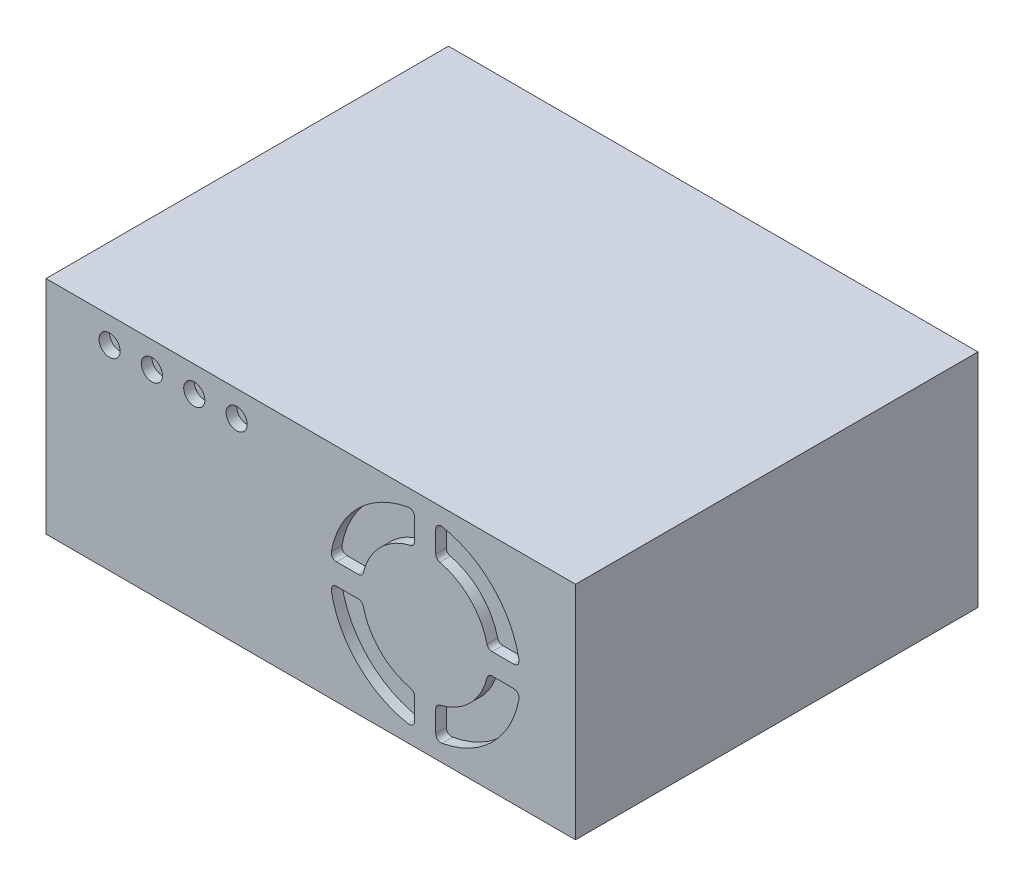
ISO-10303-21;
HEADER;
FILE_DESCRIPTION(('STEP AP214'),'2;1');
FILE_NAME('part.step','',(''),(''),'','','');
FILE_SCHEMA(('AUTOMOTIVE_DESIGN { 1 0 10303 214 1 1 1 1 }'));
ENDSEC;
DATA;
#1=APPLICATION_CONTEXT('core data for automotive mechanical design processes');
#2=APPLICATION_PROTOCOL_DEFINITION('international standard','automotive_design',2000,#1);
#3=PRODUCT_CONTEXT('',#1,'mechanical');
#4=PRODUCT('Part','Part','',(#3));
#5=PRODUCT_RELATED_PRODUCT_CATEGORY('part','',(#4));
#6=PRODUCT_DEFINITION_FORMATION('','',#4);
#7=PRODUCT_DEFINITION_CONTEXT('part definition',#1,'design');
#8=PRODUCT_DEFINITION('design','',#6,#7);
#9=PRODUCT_DEFINITION_SHAPE('','',#8);
#10=(LENGTH_UNIT() NAMED_UNIT(*) SI_UNIT(.MILLI.,.METRE.));
#11=(NAMED_UNIT(*) PLANE_ANGLE_UNIT() SI_UNIT($,.RADIAN.));
#12=(NAMED_UNIT(*) SI_UNIT($,.STERADIAN.) SOLID_ANGLE_UNIT());
#13=UNCERTAINTY_MEASURE_WITH_UNIT(LENGTH_MEASURE(1.E-05),#10,'distance_accuracy_value','');
#14=(GEOMETRIC_REPRESENTATION_CONTEXT(3) GLOBAL_UNCERTAINTY_ASSIGNED_CONTEXT((#13)) GLOBAL_UNIT_ASSIGNED_CONTEXT((#10,
#11,#12)) REPRESENTATION_CONTEXT('',''));
#15=CARTESIAN_POINT('',(0.,0.,0.));
#16=DIRECTION('',(0.,0.,1.));
#17=DIRECTION('',(1.,0.,0.));
#18=AXIS2_PLACEMENT_3D('',#15,#16,#17);
#19=CARTESIAN_POINT('',(0.,20.9,0.));
#20=DIRECTION('',(1.,0.,0.));
#21=DIRECTION('',(0.,0.,-1.));
#22=AXIS2_PLACEMENT_3D('',#19,#20,#21);
#23=PLANE('',#22);
#24=DIRECTION('',(0.,0.,1.));
#25=VECTOR('',#24,1.);
#26=CARTESIAN_POINT('',(0.,0.,0.));
#27=LINE('',#26,#25);
#28=CARTESIAN_POINT('',(0.,0.,-38.));
#29=VERTEX_POINT('',#28);
#30=CARTESIAN_POINT('',(0.,0.,0.));
#31=VERTEX_POINT('',#30);
#32=EDGE_CURVE('E574',#29,#31,#27,.T.);
#33=ORIENTED_EDGE('',*,*,#32,.T.);
#34=DIRECTION('',(0.,-1.,0.));
#35=VECTOR('',#34,1.);
#36=CARTESIAN_POINT('',(0.,20.9,0.));
#37=LINE('',#36,#35);
#38=CARTESIAN_POINT('',(0.,20.9,0.));
#39=VERTEX_POINT('',#38);
#40=EDGE_CURVE('E11',#39,#31,#37,.T.);
#41=ORIENTED_EDGE('',*,*,#40,.F.);
#42=DIRECTION('',(0.,0.,1.));
#43=VECTOR('',#42,1.);
#44=CARTESIAN_POINT('',(0.,20.9,0.));
#45=LINE('',#44,#43);
#46=CARTESIAN_POINT('',(0.,20.9,-38.));
#47=VERTEX_POINT('',#46);
#48=EDGE_CURVE('E589',#47,#39,#45,.T.);
#49=ORIENTED_EDGE('',*,*,#48,.F.);
#50=DIRECTION('',(0.,-1.,0.));
#51=VECTOR('',#50,1.);
#52=CARTESIAN_POINT('',(0.,20.9,-38.));
#53=LINE('',#52,#51);
#54=EDGE_CURVE('E599',#47,#29,#53,.T.);
#55=ORIENTED_EDGE('',*,*,#54,.T.);
#56=EDGE_LOOP('',(#33,#41,#49,#55));
#57=FACE_BOUND('',#56,.T.);
#58=ADVANCED_FACE('F36',(#57),#23,.F.);
#59=CARTESIAN_POINT('',(0.,20.9,0.));
#60=DIRECTION('',(0.,0.,-1.));
#61=DIRECTION('',(-1.,0.,0.));
#62=AXIS2_PLACEMENT_3D('',#59,#60,#61);
#63=PLANE('',#62);
#64=CARTESIAN_POINT('',(6.,18.45,0.));
#65=DIRECTION('',(0.,0.,1.));
#66=DIRECTION('',(1.,0.,0.));
#67=AXIS2_PLACEMENT_3D('',#64,#65,#66);
#68=CIRCLE('',#67,1.);
#69=CARTESIAN_POINT('',(7.,18.45,0.));
#70=VERTEX_POINT('',#69);
#71=EDGE_CURVE('E842',#70,#70,#68,.T.);
#72=ORIENTED_EDGE('',*,*,#71,.F.);
#73=EDGE_LOOP('',(#72));
#74=FACE_BOUND('',#73,.T.);
#75=CARTESIAN_POINT('',(10.,18.45,0.));
#76=DIRECTION('',(0.,0.,1.));
#77=DIRECTION('',(1.,0.,0.));
#78=AXIS2_PLACEMENT_3D('',#75,#76,#77);
#79=CIRCLE('',#78,1.);
#80=CARTESIAN_POINT('',(11.,18.45,0.));
#81=VERTEX_POINT('',#80);
#82=EDGE_CURVE('E850',#81,#81,#79,.T.);
#83=ORIENTED_EDGE('',*,*,#82,.F.);
#84=EDGE_LOOP('',(#83));
#85=FACE_BOUND('',#84,.T.);
#86=CARTESIAN_POINT('',(14.,18.45,0.));
#87=DIRECTION('',(0.,0.,1.));
#88=DIRECTION('',(1.,0.,0.));
#89=AXIS2_PLACEMENT_3D('',#86,#87,#88);
#90=CIRCLE('',#89,1.);
#91=CARTESIAN_POINT('',(15.,18.45,0.));
#92=VERTEX_POINT('',#91);
#93=EDGE_CURVE('E856',#92,#92,#90,.T.);
#94=ORIENTED_EDGE('',*,*,#93,.F.);
#95=EDGE_LOOP('',(#94));
#96=FACE_BOUND('',#95,.T.);
#97=CARTESIAN_POINT('',(18.,18.45,0.));
#98=DIRECTION('',(0.,0.,1.));
#99=DIRECTION('',(1.,0.,0.));
#100=AXIS2_PLACEMENT_3D('',#97,#98,#99);
#101=CIRCLE('',#100,0.999999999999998);
#102=CARTESIAN_POINT('',(19.,18.45,0.));
#103=VERTEX_POINT('',#102);
#104=EDGE_CURVE('E318',#103,#103,#101,.T.);
#105=ORIENTED_EDGE('',*,*,#104,.F.);
#106=EDGE_LOOP('',(#105));
#107=FACE_BOUND('',#106,.T.);
#108=CARTESIAN_POINT('',(35.8,10.45,0.));
#109=DIRECTION('',(0.,0.,-1.));
#110=DIRECTION('',(1.,0.,0.));
#111=AXIS2_PLACEMENT_3D('',#108,#109,#110);
#112=CIRCLE('',#111,5.99999999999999);
#113=CARTESIAN_POINT('',(29.9619489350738,11.8346153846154,0.));
#114=VERTEX_POINT('',#113);
#115=CARTESIAN_POINT('',(34.4153846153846,16.2880510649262,0.));
#116=VERTEX_POINT('',#115);
#117=EDGE_CURVE('E491',#114,#116,#112,.T.);
#118=ORIENTED_EDGE('',*,*,#117,.F.);
#119=CARTESIAN_POINT('',(29.4754446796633,11.95,0.));
#120=DIRECTION('',(0.,0.,1.));
#121=DIRECTION('',(-1.,0.,0.));
#122=AXIS2_PLACEMENT_3D('',#119,#120,#121);
#123=CIRCLE('',#122,0.499999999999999);
#124=CARTESIAN_POINT('',(29.4754446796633,11.45,0.));
#125=VERTEX_POINT('',#124);
#126=EDGE_CURVE('E58',#125,#114,#123,.T.);
#127=ORIENTED_EDGE('',*,*,#126,.F.);
#128=DIRECTION('',(1.,0.,0.));
#129=VECTOR('',#128,1.);
#130=CARTESIAN_POINT('',(27.4333997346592,11.45,0.));
#131=LINE('',#130,#129);
#132=CARTESIAN_POINT('',(27.4333997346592,11.45,0.));
#133=VERTEX_POINT('',#132);
#134=EDGE_CURVE('E468',#133,#125,#131,.T.);
#135=ORIENTED_EDGE('',*,*,#134,.F.);
#136=CARTESIAN_POINT('',(27.4333997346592,11.95,0.));
#137=DIRECTION('',(0.,0.,1.));
#138=DIRECTION('',(-1.,0.,0.));
#139=AXIS2_PLACEMENT_3D('',#136,#137,#138);
#140=CIRCLE('',#139,0.500000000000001);
#141=CARTESIAN_POINT('',(26.9412467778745,12.0382352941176,0.));
#142=VERTEX_POINT('',#141);
#143=EDGE_CURVE('E506',#142,#133,#140,.T.);
#144=ORIENTED_EDGE('',*,*,#143,.F.);
#145=CARTESIAN_POINT('',(35.8,10.45,0.));
#146=DIRECTION('',(0.,0.,1.));
#147=DIRECTION('',(1.,0.,0.));
#148=AXIS2_PLACEMENT_3D('',#145,#146,#147);
#149=CIRCLE('',#148,9.);
#150=CARTESIAN_POINT('',(34.2117647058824,19.3087532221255,0.));
#151=VERTEX_POINT('',#150);
#152=EDGE_CURVE('E503',#151,#142,#149,.T.);
#153=ORIENTED_EDGE('',*,*,#152,.F.);
#154=CARTESIAN_POINT('',(34.3,18.8166002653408,0.));
#155=DIRECTION('',(0.,0.,1.));
#156=DIRECTION('',(-1.,0.,0.));
#157=AXIS2_PLACEMENT_3D('',#154,#155,#156);
#158=CIRCLE('',#157,0.500000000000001);
#159=CARTESIAN_POINT('',(34.8,18.8166002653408,0.));
#160=VERTEX_POINT('',#159);
#161=EDGE_CURVE('E500',#160,#151,#158,.T.);
#162=ORIENTED_EDGE('',*,*,#161,.F.);
#163=DIRECTION('',(0.,1.,0.));
#164=VECTOR('',#163,1.);
#165=CARTESIAN_POINT('',(34.8,18.8166002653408,0.));
#166=LINE('',#165,#164);
#167=CARTESIAN_POINT('',(34.8,16.7745553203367,0.));
#168=VERTEX_POINT('',#167);
#169=EDGE_CURVE('E497',#168,#160,#166,.T.);
#170=ORIENTED_EDGE('',*,*,#169,.F.);
#171=CARTESIAN_POINT('',(34.3,16.7745553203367,0.));
#172=DIRECTION('',(0.,0.,1.));
#173=DIRECTION('',(-1.,0.,0.));
#174=AXIS2_PLACEMENT_3D('',#171,#172,#173);
#175=CIRCLE('',#174,0.499999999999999);
#176=EDGE_CURVE('E494',#116,#168,#175,.T.);
#177=ORIENTED_EDGE('',*,*,#176,.F.);
#178=EDGE_LOOP('',(#118,#127,#135,#144,#153,#162,#170,#177));
#179=FACE_BOUND('',#178,.T.);
#180=DIRECTION('',(0.,1.,0.));
#181=VECTOR('',#180,1.);
#182=CARTESIAN_POINT('',(34.8,4.12544467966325,0.));
#183=LINE('',#182,#181);
#184=CARTESIAN_POINT('',(34.8,2.08339973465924,0.));
#185=VERTEX_POINT('',#184);
#186=CARTESIAN_POINT('',(34.8,4.12544467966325,0.));
#187=VERTEX_POINT('',#186);
#188=EDGE_CURVE('E428',#185,#187,#183,.T.);
#189=ORIENTED_EDGE('',*,*,#188,.F.);
#190=CARTESIAN_POINT('',(34.3,2.08339973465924,0.));
#191=DIRECTION('',(0.,0.,1.));
#192=DIRECTION('',(1.,0.,0.));
#193=AXIS2_PLACEMENT_3D('',#190,#191,#192);
#194=CIRCLE('',#193,0.500000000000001);
#195=CARTESIAN_POINT('',(34.2117647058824,1.59124677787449,0.));
#196=VERTEX_POINT('',#195);
#197=EDGE_CURVE('E426',#196,#185,#194,.T.);
#198=ORIENTED_EDGE('',*,*,#197,.F.);
#199=CARTESIAN_POINT('',(35.8,10.45,0.));
#200=DIRECTION('',(0.,0.,1.));
#201=DIRECTION('',(1.,0.,0.));
#202=AXIS2_PLACEMENT_3D('',#199,#200,#201);
#203=CIRCLE('',#202,9.);
#204=CARTESIAN_POINT('',(26.9412467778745,8.86176470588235,0.));
#205=VERTEX_POINT('',#204);
#206=EDGE_CURVE('E404',#205,#196,#203,.T.);
#207=ORIENTED_EDGE('',*,*,#206,.F.);
#208=CARTESIAN_POINT('',(27.4333997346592,8.95,0.));
#209=DIRECTION('',(0.,0.,1.));
#210=DIRECTION('',(1.,0.,0.));
#211=AXIS2_PLACEMENT_3D('',#208,#209,#210);
#212=CIRCLE('',#211,0.500000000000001);
#213=CARTESIAN_POINT('',(27.4333997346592,9.45,0.));
#214=VERTEX_POINT('',#213);
#215=EDGE_CURVE('E444',#214,#205,#212,.T.);
#216=ORIENTED_EDGE('',*,*,#215,.F.);
#217=DIRECTION('',(-1.,0.,0.));
#218=VECTOR('',#217,1.);
#219=CARTESIAN_POINT('',(27.4333997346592,9.45,0.));
#220=LINE('',#219,#218);
#221=CARTESIAN_POINT('',(29.4754446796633,9.45,0.));
#222=VERTEX_POINT('',#221);
#223=EDGE_CURVE('E441',#222,#214,#220,.T.);
#224=ORIENTED_EDGE('',*,*,#223,.F.);
#225=CARTESIAN_POINT('',(29.4754446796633,8.95,0.));
#226=DIRECTION('',(0.,0.,1.));
#227=DIRECTION('',(1.,0.,0.));
#228=AXIS2_PLACEMENT_3D('',#225,#226,#227);
#229=CIRCLE('',#228,0.499999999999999);
#230=CARTESIAN_POINT('',(29.9619489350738,9.06538461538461,0.));
#231=VERTEX_POINT('',#230);
#232=EDGE_CURVE('E438',#231,#222,#229,.T.);
#233=ORIENTED_EDGE('',*,*,#232,.F.);
#234=CARTESIAN_POINT('',(35.8,10.45,0.));
#235=DIRECTION('',(0.,0.,-1.));
#236=DIRECTION('',(1.,0.,0.));
#237=AXIS2_PLACEMENT_3D('',#234,#235,#236);
#238=CIRCLE('',#237,5.99999999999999);
#239=CARTESIAN_POINT('',(34.4153846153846,4.61194893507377,0.));
#240=VERTEX_POINT('',#239);
#241=EDGE_CURVE('E435',#240,#231,#238,.T.);
#242=ORIENTED_EDGE('',*,*,#241,.F.);
#243=CARTESIAN_POINT('',(34.3,4.12544467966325,0.));
#244=DIRECTION('',(0.,0.,1.));
#245=DIRECTION('',(-1.,0.,0.));
#246=AXIS2_PLACEMENT_3D('',#243,#244,#245);
#247=CIRCLE('',#246,0.5);
#248=EDGE_CURVE('E432',#187,#240,#247,.T.);
#249=ORIENTED_EDGE('',*,*,#248,.F.);
#250=EDGE_LOOP('',(#189,#198,#207,#216,#224,#233,#242,#249));
#251=FACE_BOUND('',#250,.T.);
#252=DIRECTION('',(-1.,0.,0.));
#253=VECTOR('',#252,1.);
#254=CARTESIAN_POINT('',(42.1245553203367,9.45,0.));
#255=LINE('',#254,#253);
#256=CARTESIAN_POINT('',(44.1666002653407,9.45,0.));
#257=VERTEX_POINT('',#256);
#258=CARTESIAN_POINT('',(42.1245553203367,9.45,0.));
#259=VERTEX_POINT('',#258);
#260=EDGE_CURVE('E362',#257,#259,#255,.T.);
#261=ORIENTED_EDGE('',*,*,#260,.F.);
#262=CARTESIAN_POINT('',(44.1666002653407,8.95,0.));
#263=DIRECTION('',(0.,0.,1.));
#264=DIRECTION('',(1.,0.,0.));
#265=AXIS2_PLACEMENT_3D('',#262,#263,#264);
#266=CIRCLE('',#265,0.500000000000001);
#267=CARTESIAN_POINT('',(44.6587532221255,8.86176470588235,0.));
#268=VERTEX_POINT('',#267);
#269=EDGE_CURVE('E360',#268,#257,#266,.T.);
#270=ORIENTED_EDGE('',*,*,#269,.F.);
#271=CARTESIAN_POINT('',(35.8,10.45,0.));
#272=DIRECTION('',(0.,0.,1.));
#273=DIRECTION('',(1.,0.,0.));
#274=AXIS2_PLACEMENT_3D('',#271,#272,#273);
#275=CIRCLE('',#274,9.);
#276=CARTESIAN_POINT('',(37.3882352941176,1.59124677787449,0.));
#277=VERTEX_POINT('',#276);
#278=EDGE_CURVE('E338',#277,#268,#275,.T.);
#279=ORIENTED_EDGE('',*,*,#278,.F.);
#280=CARTESIAN_POINT('',(37.3,2.08339973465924,0.));
#281=DIRECTION('',(0.,0.,1.));
#282=DIRECTION('',(-1.,0.,0.));
#283=AXIS2_PLACEMENT_3D('',#280,#281,#282);
#284=CIRCLE('',#283,0.500000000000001);
#285=CARTESIAN_POINT('',(36.8,2.08339973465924,0.));
#286=VERTEX_POINT('',#285);
#287=EDGE_CURVE('E378',#286,#277,#284,.T.);
#288=ORIENTED_EDGE('',*,*,#287,.F.);
#289=DIRECTION('',(0.,-1.,0.));
#290=VECTOR('',#289,1.);
#291=CARTESIAN_POINT('',(36.8,4.12544467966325,0.));
#292=LINE('',#291,#290);
#293=CARTESIAN_POINT('',(36.8,4.12544467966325,0.));
#294=VERTEX_POINT('',#293);
#295=EDGE_CURVE('E375',#294,#286,#292,.T.);
#296=ORIENTED_EDGE('',*,*,#295,.F.);
#297=CARTESIAN_POINT('',(37.3,4.12544467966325,0.));
#298=DIRECTION('',(0.,0.,1.));
#299=DIRECTION('',(1.,0.,0.));
#300=AXIS2_PLACEMENT_3D('',#297,#298,#299);
#301=CIRCLE('',#300,0.5);
#302=CARTESIAN_POINT('',(37.1846153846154,4.61194893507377,0.));
#303=VERTEX_POINT('',#302);
#304=EDGE_CURVE('E372',#303,#294,#301,.T.);
#305=ORIENTED_EDGE('',*,*,#304,.F.);
#306=CARTESIAN_POINT('',(35.8,10.45,0.));
#307=DIRECTION('',(0.,0.,-1.));
#308=DIRECTION('',(1.,0.,0.));
#309=AXIS2_PLACEMENT_3D('',#306,#307,#308);
#310=CIRCLE('',#309,5.99999999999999);
#311=CARTESIAN_POINT('',(41.6380510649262,9.06538461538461,0.));
#312=VERTEX_POINT('',#311);
#313=EDGE_CURVE('E369',#312,#303,#310,.T.);
#314=ORIENTED_EDGE('',*,*,#313,.F.);
#315=CARTESIAN_POINT('',(42.1245553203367,8.95,0.));
#316=DIRECTION('',(0.,0.,1.));
#317=DIRECTION('',(1.,0.,0.));
#318=AXIS2_PLACEMENT_3D('',#315,#316,#317);
#319=CIRCLE('',#318,0.499999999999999);
#320=EDGE_CURVE('E366',#259,#312,#319,.T.);
#321=ORIENTED_EDGE('',*,*,#320,.F.);
#322=EDGE_LOOP('',(#261,#270,#279,#288,#296,#305,#314,#321));
#323=FACE_BOUND('',#322,.T.);
#324=DIRECTION('',(0.,-1.,0.));
#325=VECTOR('',#324,1.);
#326=CARTESIAN_POINT('',(36.8,18.8166002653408,0.));
#327=LINE('',#326,#325);
#328=CARTESIAN_POINT('',(36.8,18.8166002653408,0.));
#329=VERTEX_POINT('',#328);
#330=CARTESIAN_POINT('',(36.8,16.7745553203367,0.));
#331=VERTEX_POINT('',#330);
#332=EDGE_CURVE('E552',#329,#331,#327,.T.);
#333=ORIENTED_EDGE('',*,*,#332,.F.);
#334=CARTESIAN_POINT('',(37.3,18.8166002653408,0.));
#335=DIRECTION('',(0.,0.,1.));
#336=DIRECTION('',(1.,0.,0.));
#337=AXIS2_PLACEMENT_3D('',#334,#335,#336);
#338=CIRCLE('',#337,0.500000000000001);
#339=CARTESIAN_POINT('',(37.3882352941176,19.3087532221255,0.));
#340=VERTEX_POINT('',#339);
#341=EDGE_CURVE('E385',#340,#329,#338,.T.);
#342=ORIENTED_EDGE('',*,*,#341,.F.);
#343=CARTESIAN_POINT('',(35.8,10.45,0.));
#344=DIRECTION('',(0.,0.,1.));
#345=DIRECTION('',(1.,0.,0.));
#346=AXIS2_PLACEMENT_3D('',#343,#344,#345);
#347=CIRCLE('',#346,9.);
#348=CARTESIAN_POINT('',(44.6587532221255,12.0382352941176,0.));
#349=VERTEX_POINT('',#348);
#350=EDGE_CURVE('E529',#349,#340,#347,.T.);
#351=ORIENTED_EDGE('',*,*,#350,.F.);
#352=CARTESIAN_POINT('',(44.1666002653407,11.95,0.));
#353=DIRECTION('',(0.,0.,1.));
#354=DIRECTION('',(-1.,0.,0.));
#355=AXIS2_PLACEMENT_3D('',#352,#353,#354);
#356=CIRCLE('',#355,0.500000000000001);
#357=CARTESIAN_POINT('',(44.1666002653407,11.45,0.));
#358=VERTEX_POINT('',#357);
#359=EDGE_CURVE('E567',#358,#349,#356,.T.);
#360=ORIENTED_EDGE('',*,*,#359,.F.);
#361=DIRECTION('',(1.,0.,0.));
#362=VECTOR('',#361,1.);
#363=CARTESIAN_POINT('',(42.1245553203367,11.45,0.));
#364=LINE('',#363,#362);
#365=CARTESIAN_POINT('',(42.1245553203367,11.45,0.));
#366=VERTEX_POINT('',#365);
#367=EDGE_CURVE('E564',#366,#358,#364,.T.);
#368=ORIENTED_EDGE('',*,*,#367,.F.);
#369=CARTESIAN_POINT('',(42.1245553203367,11.95,0.));
#370=DIRECTION('',(0.,0.,1.));
#371=DIRECTION('',(-1.,0.,0.));
#372=AXIS2_PLACEMENT_3D('',#369,#370,#371);
#373=CIRCLE('',#372,0.499999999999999);
#374=CARTESIAN_POINT('',(41.6380510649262,11.8346153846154,0.));
#375=VERTEX_POINT('',#374);
#376=EDGE_CURVE('E561',#375,#366,#373,.T.);
#377=ORIENTED_EDGE('',*,*,#376,.F.);
#378=CARTESIAN_POINT('',(35.8,10.45,0.));
#379=DIRECTION('',(0.,0.,-1.));
#380=DIRECTION('',(1.,0.,0.));
#381=AXIS2_PLACEMENT_3D('',#378,#379,#380);
#382=CIRCLE('',#381,5.99999999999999);
#383=CARTESIAN_POINT('',(37.1846153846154,16.2880510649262,0.));
#384=VERTEX_POINT('',#383);
#385=EDGE_CURVE('E558',#384,#375,#382,.T.);
#386=ORIENTED_EDGE('',*,*,#385,.F.);
#387=CARTESIAN_POINT('',(37.3,16.7745553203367,0.));
#388=DIRECTION('',(0.,0.,1.));
#389=DIRECTION('',(1.,0.,0.));
#390=AXIS2_PLACEMENT_3D('',#387,#388,#389);
#391=CIRCLE('',#390,0.499999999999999);
#392=EDGE_CURVE('E555',#331,#384,#391,.T.);
#393=ORIENTED_EDGE('',*,*,#392,.F.);
#394=EDGE_LOOP('',(#333,#342,#351,#360,#368,#377,#386,#393));
#395=FACE_BOUND('',#394,.T.);
#396=DIRECTION('',(1.,0.,0.));
#397=VECTOR('',#396,1.);
#398=CARTESIAN_POINT('',(0.,0.,0.));
#399=LINE('',#398,#397);
#400=CARTESIAN_POINT('',(50.,0.,0.));
#401=VERTEX_POINT('',#400);
#402=EDGE_CURVE('E602',#31,#401,#399,.T.);
#403=ORIENTED_EDGE('',*,*,#402,.T.);
#404=DIRECTION('',(0.,-1.,0.));
#405=VECTOR('',#404,1.);
#406=CARTESIAN_POINT('',(50.,20.9,0.));
#407=LINE('',#406,#405);
#408=CARTESIAN_POINT('',(50.,20.9,0.));
#409=VERTEX_POINT('',#408);
#410=EDGE_CURVE('E43',#409,#401,#407,.T.);
#411=ORIENTED_EDGE('',*,*,#410,.F.);
#412=DIRECTION('',(1.,0.,0.));
#413=VECTOR('',#412,1.);
#414=CARTESIAN_POINT('',(0.,20.9,0.));
#415=LINE('',#414,#413);
#416=EDGE_CURVE('E592',#39,#409,#415,.T.);
#417=ORIENTED_EDGE('',*,*,#416,.F.);
#418=ORIENTED_EDGE('',*,*,#40,.T.);
#419=EDGE_LOOP('',(#403,#411,#417,#418));
#420=FACE_BOUND('',#419,.T.);
#421=ADVANCED_FACE('F632',(#74,#85,#96,#107,#179,#251,#323,#395,#420),#63,.F.);
#422=CARTESIAN_POINT('',(50.,20.9,0.));
#423=DIRECTION('',(-1.,0.,0.));
#424=DIRECTION('',(0.,0.,1.));
#425=AXIS2_PLACEMENT_3D('',#422,#423,#424);
#426=PLANE('',#425);
#427=DIRECTION('',(0.,0.,-1.));
#428=VECTOR('',#427,1.);
#429=CARTESIAN_POINT('',(50.,0.,0.));
#430=LINE('',#429,#428);
#431=CARTESIAN_POINT('',(50.,0.,-38.));
#432=VERTEX_POINT('',#431);
#433=EDGE_CURVE('E604',#401,#432,#430,.T.);
#434=ORIENTED_EDGE('',*,*,#433,.T.);
#435=DIRECTION('',(0.,-1.,0.));
#436=VECTOR('',#435,1.);
#437=CARTESIAN_POINT('',(50.,20.9,-38.));
#438=LINE('',#437,#436);
#439=CARTESIAN_POINT('',(50.,20.9,-38.));
#440=VERTEX_POINT('',#439);
#441=EDGE_CURVE('E609',#440,#432,#438,.T.);
#442=ORIENTED_EDGE('',*,*,#441,.F.);
#443=DIRECTION('',(0.,0.,-1.));
#444=VECTOR('',#443,1.);
#445=CARTESIAN_POINT('',(50.,20.9,0.));
#446=LINE('',#445,#444);
#447=EDGE_CURVE('E595',#409,#440,#446,.T.);
#448=ORIENTED_EDGE('',*,*,#447,.F.);
#449=ORIENTED_EDGE('',*,*,#410,.T.);
#450=EDGE_LOOP('',(#434,#442,#448,#449));
#451=FACE_BOUND('',#450,.T.);
#452=ADVANCED_FACE('F616',(#451),#426,.F.);
#453=CARTESIAN_POINT('',(0.,20.9,-38.));
#454=DIRECTION('',(0.,0.,1.));
#455=DIRECTION('',(1.,0.,0.));
#456=AXIS2_PLACEMENT_3D('',#453,#454,#455);
#457=PLANE('',#456);
#458=DIRECTION('',(-1.,0.,0.));
#459=VECTOR('',#458,1.);
#460=CARTESIAN_POINT('',(44.5,8.,-38.));
#461=LINE('',#460,#459);
#462=CARTESIAN_POINT('',(44.5,8.,-38.));
#463=VERTEX_POINT('',#462);
#464=CARTESIAN_POINT('',(27.5,8.,-38.));
#465=VERTEX_POINT('',#464);
#466=EDGE_CURVE('E324',#463,#465,#461,.T.);
#467=ORIENTED_EDGE('',*,*,#466,.F.);
#468=DIRECTION('',(0.,-1.,0.));
#469=VECTOR('',#468,1.);
#470=CARTESIAN_POINT('',(44.5,12.9,-38.));
#471=LINE('',#470,#469);
#472=CARTESIAN_POINT('',(44.5,12.9,-38.));
#473=VERTEX_POINT('',#472);
#474=EDGE_CURVE('E50',#473,#463,#471,.T.);
#475=ORIENTED_EDGE('',*,*,#474,.F.);
#476=DIRECTION('',(1.,0.,0.));
#477=VECTOR('',#476,1.);
#478=CARTESIAN_POINT('',(44.5,12.9,-38.));
#479=LINE('',#478,#477);
#480=CARTESIAN_POINT('',(27.5,12.9,-38.));
#481=VERTEX_POINT('',#480);
#482=EDGE_CURVE('E312',#481,#473,#479,.T.);
#483=ORIENTED_EDGE('',*,*,#482,.F.);
#484=DIRECTION('',(0.,1.,0.));
#485=VECTOR('',#484,1.);
#486=CARTESIAN_POINT('',(27.5,12.9,-38.));
#487=LINE('',#486,#485);
#488=EDGE_CURVE('E315',#465,#481,#487,.T.);
#489=ORIENTED_EDGE('',*,*,#488,.F.);
#490=EDGE_LOOP('',(#467,#475,#483,#489));
#491=FACE_BOUND('',#490,.T.);
#492=DIRECTION('',(-1.,0.,0.));
#493=VECTOR('',#492,1.);
#494=CARTESIAN_POINT('',(0.,0.,-38.));
#495=LINE('',#494,#493);
#496=EDGE_CURVE('E593',#432,#29,#495,.T.);
#497=ORIENTED_EDGE('',*,*,#496,.T.);
#498=ORIENTED_EDGE('',*,*,#54,.F.);
#499=DIRECTION('',(-1.,0.,0.));
#500=VECTOR('',#499,1.);
#501=CARTESIAN_POINT('',(0.,20.9,-38.));
#502=LINE('',#501,#500);
#503=EDGE_CURVE('E597',#440,#47,#502,.T.);
#504=ORIENTED_EDGE('',*,*,#503,.F.);
#505=ORIENTED_EDGE('',*,*,#441,.T.);
#506=EDGE_LOOP('',(#497,#498,#504,#505));
#507=FACE_BOUND('',#506,.T.);
#508=ADVANCED_FACE('F625',(#491,#507),#457,.F.);
#509=CARTESIAN_POINT('',(0.,20.9,0.));
#510=DIRECTION('',(0.,-1.,0.));
#511=DIRECTION('',(0.,0.,-1.));
#512=AXIS2_PLACEMENT_3D('',#509,#510,#511);
#513=PLANE('',#512);
#514=ORIENTED_EDGE('',*,*,#48,.T.);
#515=ORIENTED_EDGE('',*,*,#416,.T.);
#516=ORIENTED_EDGE('',*,*,#447,.T.);
#517=ORIENTED_EDGE('',*,*,#503,.T.);
#518=EDGE_LOOP('',(#514,#515,#516,#517));
#519=FACE_BOUND('',#518,.T.);
#520=ADVANCED_FACE('F631',(#519),#513,.F.);
#521=CARTESIAN_POINT('',(0.,0.,0.));
#522=DIRECTION('',(0.,-1.,0.));
#523=DIRECTION('',(0.,0.,-1.));
#524=AXIS2_PLACEMENT_3D('',#521,#522,#523);
#525=PLANE('',#524);
#526=ORIENTED_EDGE('',*,*,#32,.F.);
#527=ORIENTED_EDGE('',*,*,#496,.F.);
#528=ORIENTED_EDGE('',*,*,#433,.F.);
#529=ORIENTED_EDGE('',*,*,#402,.F.);
#530=EDGE_LOOP('',(#526,#527,#528,#529));
#531=FACE_BOUND('',#530,.T.);
#532=ADVANCED_FACE('F622',(#531),#525,.T.);
#533=CARTESIAN_POINT('',(37.3,18.8166002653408,-1.));
#534=DIRECTION('',(0.,0.,1.));
#535=DIRECTION('',(1.,0.,0.));
#536=AXIS2_PLACEMENT_3D('',#533,#534,#535);
#537=CYLINDRICAL_SURFACE('',#536,0.500000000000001);
#538=ORIENTED_EDGE('',*,*,#341,.T.);
#539=DIRECTION('',(0.,0.,1.));
#540=VECTOR('',#539,1.);
#541=CARTESIAN_POINT('',(36.8,18.8166002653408,-1.));
#542=LINE('',#541,#540);
#543=CARTESIAN_POINT('',(36.8,18.8166002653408,-1.));
#544=VERTEX_POINT('',#543);
#545=EDGE_CURVE('E550',#544,#329,#542,.T.);
#546=ORIENTED_EDGE('',*,*,#545,.F.);
#547=CARTESIAN_POINT('',(37.3,18.8166002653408,-1.));
#548=DIRECTION('',(0.,0.,1.));
#549=DIRECTION('',(1.,0.,0.));
#550=AXIS2_PLACEMENT_3D('',#547,#548,#549);
#551=CIRCLE('',#550,0.500000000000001);
#552=CARTESIAN_POINT('',(37.3882352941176,19.3087532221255,-1.));
#553=VERTEX_POINT('',#552);
#554=EDGE_CURVE('E525',#553,#544,#551,.T.);
#555=ORIENTED_EDGE('',*,*,#554,.F.);
#556=DIRECTION('',(0.,0.,1.));
#557=VECTOR('',#556,1.);
#558=CARTESIAN_POINT('',(37.3882352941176,19.3087532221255,-1.));
#559=LINE('',#558,#557);
#560=EDGE_CURVE('E572',#553,#340,#559,.T.);
#561=ORIENTED_EDGE('',*,*,#560,.T.);
#562=EDGE_LOOP('',(#538,#546,#555,#561));
#563=FACE_BOUND('',#562,.T.);
#564=ADVANCED_FACE('F648',(#563),#537,.F.);
#565=CARTESIAN_POINT('',(35.8,10.45,-1.));
#566=DIRECTION('',(0.,0.,1.));
#567=DIRECTION('',(1.,0.,0.));
#568=AXIS2_PLACEMENT_3D('',#565,#566,#567);
#569=CYLINDRICAL_SURFACE('',#568,9.);
#570=ORIENTED_EDGE('',*,*,#350,.T.);
#571=ORIENTED_EDGE('',*,*,#560,.F.);
#572=CARTESIAN_POINT('',(35.8,10.45,-1.));
#573=DIRECTION('',(0.,0.,1.));
#574=DIRECTION('',(1.,0.,0.));
#575=AXIS2_PLACEMENT_3D('',#572,#573,#574);
#576=CIRCLE('',#575,9.);
#577=CARTESIAN_POINT('',(44.6587532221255,12.0382352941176,-1.));
#578=VERTEX_POINT('',#577);
#579=EDGE_CURVE('E547',#578,#553,#576,.T.);
#580=ORIENTED_EDGE('',*,*,#579,.F.);
#581=DIRECTION('',(0.,0.,1.));
#582=VECTOR('',#581,1.);
#583=CARTESIAN_POINT('',(44.6587532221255,12.0382352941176,-1.));
#584=LINE('',#583,#582);
#585=EDGE_CURVE('E575',#578,#349,#584,.T.);
#586=ORIENTED_EDGE('',*,*,#585,.T.);
#587=EDGE_LOOP('',(#570,#571,#580,#586));
#588=FACE_BOUND('',#587,.T.);
#589=ADVANCED_FACE('F653',(#588),#569,.F.);
#590=CARTESIAN_POINT('',(44.1666002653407,11.95,-1.));
#591=DIRECTION('',(0.,0.,1.));
#592=DIRECTION('',(1.,0.,0.));
#593=AXIS2_PLACEMENT_3D('',#590,#591,#592);
#594=CYLINDRICAL_SURFACE('',#593,0.500000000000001);
#595=ORIENTED_EDGE('',*,*,#359,.T.);
#596=ORIENTED_EDGE('',*,*,#585,.F.);
#597=CARTESIAN_POINT('',(44.1666002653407,11.95,-1.));
#598=DIRECTION('',(0.,0.,1.));
#599=DIRECTION('',(-1.,0.,0.));
#600=AXIS2_PLACEMENT_3D('',#597,#598,#599);
#601=CIRCLE('',#600,0.500000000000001);
#602=CARTESIAN_POINT('',(44.1666002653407,11.45,-1.));
#603=VERTEX_POINT('',#602);
#604=EDGE_CURVE('E544',#603,#578,#601,.T.);
#605=ORIENTED_EDGE('',*,*,#604,.F.);
#606=DIRECTION('',(0.,0.,1.));
#607=VECTOR('',#606,1.);
#608=CARTESIAN_POINT('',(44.1666002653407,11.45,-1.));
#609=LINE('',#608,#607);
#610=EDGE_CURVE('E577',#603,#358,#609,.T.);
#611=ORIENTED_EDGE('',*,*,#610,.T.);
#612=EDGE_LOOP('',(#595,#596,#605,#611));
#613=FACE_BOUND('',#612,.T.);
#614=ADVANCED_FACE('F675',(#613),#594,.F.);
#615=CARTESIAN_POINT('',(42.1245553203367,11.45,-1.));
#616=DIRECTION('',(0.,-1.,0.));
#617=DIRECTION('',(0.,0.,-1.));
#618=AXIS2_PLACEMENT_3D('',#615,#616,#617);
#619=PLANE('',#618);
#620=ORIENTED_EDGE('',*,*,#367,.T.);
#621=ORIENTED_EDGE('',*,*,#610,.F.);
#622=DIRECTION('',(1.,0.,0.));
#623=VECTOR('',#622,1.);
#624=CARTESIAN_POINT('',(42.1245553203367,11.45,-1.));
#625=LINE('',#624,#623);
#626=CARTESIAN_POINT('',(42.1245553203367,11.45,-1.));
#627=VERTEX_POINT('',#626);
#628=EDGE_CURVE('E541',#627,#603,#625,.T.);
#629=ORIENTED_EDGE('',*,*,#628,.F.);
#630=DIRECTION('',(0.,0.,1.));
#631=VECTOR('',#630,1.);
#632=CARTESIAN_POINT('',(42.1245553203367,11.45,-1.));
#633=LINE('',#632,#631);
#634=EDGE_CURVE('E579',#627,#366,#633,.T.);
#635=ORIENTED_EDGE('',*,*,#634,.T.);
#636=EDGE_LOOP('',(#620,#621,#629,#635));
#637=FACE_BOUND('',#636,.T.);
#638=ADVANCED_FACE('F671',(#637),#619,.F.);
#639=CARTESIAN_POINT('',(42.1245553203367,11.95,-1.));
#640=DIRECTION('',(0.,0.,1.));
#641=DIRECTION('',(1.,0.,0.));
#642=AXIS2_PLACEMENT_3D('',#639,#640,#641);
#643=CYLINDRICAL_SURFACE('',#642,0.499999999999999);
#644=ORIENTED_EDGE('',*,*,#376,.T.);
#645=ORIENTED_EDGE('',*,*,#634,.F.);
#646=CARTESIAN_POINT('',(42.1245553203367,11.95,-1.));
#647=DIRECTION('',(0.,0.,1.));
#648=DIRECTION('',(-1.,0.,0.));
#649=AXIS2_PLACEMENT_3D('',#646,#647,#648);
#650=CIRCLE('',#649,0.499999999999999);
#651=CARTESIAN_POINT('',(41.6380510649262,11.8346153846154,-1.));
#652=VERTEX_POINT('',#651);
#653=EDGE_CURVE('E538',#652,#627,#650,.T.);
#654=ORIENTED_EDGE('',*,*,#653,.F.);
#655=DIRECTION('',(0.,0.,1.));
#656=VECTOR('',#655,1.);
#657=CARTESIAN_POINT('',(41.6380510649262,11.8346153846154,-1.));
#658=LINE('',#657,#656);
#659=EDGE_CURVE('E581',#652,#375,#658,.T.);
#660=ORIENTED_EDGE('',*,*,#659,.T.);
#661=EDGE_LOOP('',(#644,#645,#654,#660));
#662=FACE_BOUND('',#661,.T.);
#663=ADVANCED_FACE('F667',(#662),#643,.F.);
#664=CARTESIAN_POINT('',(35.8,10.45,-1.));
#665=DIRECTION('',(0.,0.,1.));
#666=DIRECTION('',(1.,0.,0.));
#667=AXIS2_PLACEMENT_3D('',#664,#665,#666);
#668=CYLINDRICAL_SURFACE('',#667,5.99999999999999);
#669=ORIENTED_EDGE('',*,*,#385,.T.);
#670=ORIENTED_EDGE('',*,*,#659,.F.);
#671=CARTESIAN_POINT('',(35.8,10.45,-1.));
#672=DIRECTION('',(0.,0.,-1.));
#673=DIRECTION('',(1.,0.,0.));
#674=AXIS2_PLACEMENT_3D('',#671,#672,#673);
#675=CIRCLE('',#674,5.99999999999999);
#676=CARTESIAN_POINT('',(37.1846153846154,16.2880510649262,-1.));
#677=VERTEX_POINT('',#676);
#678=EDGE_CURVE('E535',#677,#652,#675,.T.);
#679=ORIENTED_EDGE('',*,*,#678,.F.);
#680=DIRECTION('',(0.,0.,1.));
#681=VECTOR('',#680,1.);
#682=CARTESIAN_POINT('',(37.1846153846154,16.2880510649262,-1.));
#683=LINE('',#682,#681);
#684=EDGE_CURVE('E583',#677,#384,#683,.T.);
#685=ORIENTED_EDGE('',*,*,#684,.T.);
#686=EDGE_LOOP('',(#669,#670,#679,#685));
#687=FACE_BOUND('',#686,.T.);
#688=ADVANCED_FACE('F663',(#687),#668,.T.);
#689=CARTESIAN_POINT('',(37.3,16.7745553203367,-1.));
#690=DIRECTION('',(0.,0.,1.));
#691=DIRECTION('',(1.,0.,0.));
#692=AXIS2_PLACEMENT_3D('',#689,#690,#691);
#693=CYLINDRICAL_SURFACE('',#692,0.499999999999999);
#694=ORIENTED_EDGE('',*,*,#392,.T.);
#695=ORIENTED_EDGE('',*,*,#684,.F.);
#696=CARTESIAN_POINT('',(37.3,16.7745553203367,-1.));
#697=DIRECTION('',(0.,0.,1.));
#698=DIRECTION('',(1.,0.,0.));
#699=AXIS2_PLACEMENT_3D('',#696,#697,#698);
#700=CIRCLE('',#699,0.499999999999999);
#701=CARTESIAN_POINT('',(36.8,16.7745553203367,-1.));
#702=VERTEX_POINT('',#701);
#703=EDGE_CURVE('E532',#702,#677,#700,.T.);
#704=ORIENTED_EDGE('',*,*,#703,.F.);
#705=DIRECTION('',(0.,0.,1.));
#706=VECTOR('',#705,1.);
#707=CARTESIAN_POINT('',(36.8,16.7745553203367,-1.));
#708=LINE('',#707,#706);
#709=EDGE_CURVE('E585',#702,#331,#708,.T.);
#710=ORIENTED_EDGE('',*,*,#709,.T.);
#711=EDGE_LOOP('',(#694,#695,#704,#710));
#712=FACE_BOUND('',#711,.T.);
#713=ADVANCED_FACE('F659',(#712),#693,.F.);
#714=CARTESIAN_POINT('',(36.8,18.8166002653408,-1.));
#715=DIRECTION('',(-1.,0.,0.));
#716=DIRECTION('',(0.,0.,1.));
#717=AXIS2_PLACEMENT_3D('',#714,#715,#716);
#718=PLANE('',#717);
#719=ORIENTED_EDGE('',*,*,#332,.T.);
#720=ORIENTED_EDGE('',*,*,#709,.F.);
#721=DIRECTION('',(0.,-1.,0.));
#722=VECTOR('',#721,1.);
#723=CARTESIAN_POINT('',(36.8,18.8166002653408,-1.));
#724=LINE('',#723,#722);
#725=EDGE_CURVE('E528',#544,#702,#724,.T.);
#726=ORIENTED_EDGE('',*,*,#725,.F.);
#727=ORIENTED_EDGE('',*,*,#545,.T.);
#728=EDGE_LOOP('',(#719,#720,#726,#727));
#729=FACE_BOUND('',#728,.T.);
#730=ADVANCED_FACE('F655',(#729),#718,.F.);
#731=CARTESIAN_POINT('',(37.3,18.8166002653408,-1.));
#732=DIRECTION('',(0.,0.,1.));
#733=DIRECTION('',(1.,0.,0.));
#734=AXIS2_PLACEMENT_3D('',#731,#732,#733);
#735=PLANE('',#734);
#736=ORIENTED_EDGE('',*,*,#554,.T.);
#737=ORIENTED_EDGE('',*,*,#725,.T.);
#738=ORIENTED_EDGE('',*,*,#703,.T.);
#739=ORIENTED_EDGE('',*,*,#678,.T.);
#740=ORIENTED_EDGE('',*,*,#653,.T.);
#741=ORIENTED_EDGE('',*,*,#628,.T.);
#742=ORIENTED_EDGE('',*,*,#604,.T.);
#743=ORIENTED_EDGE('',*,*,#579,.T.);
#744=EDGE_LOOP('',(#736,#737,#738,#739,#740,#741,#742,#743));
#745=FACE_BOUND('',#744,.T.);
#746=ADVANCED_FACE('F658',(#745),#735,.T.);
#747=CARTESIAN_POINT('',(44.1666002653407,8.95,-1.));
#748=DIRECTION('',(0.,0.,1.));
#749=DIRECTION('',(1.,0.,0.));
#750=AXIS2_PLACEMENT_3D('',#747,#748,#749);
#751=CYLINDRICAL_SURFACE('',#750,0.500000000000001);
#752=ORIENTED_EDGE('',*,*,#269,.T.);
#753=DIRECTION('',(0.,0.,1.));
#754=VECTOR('',#753,1.);
#755=CARTESIAN_POINT('',(44.1666002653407,9.45,-1.));
#756=LINE('',#755,#754);
#757=CARTESIAN_POINT('',(44.1666002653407,9.45,-1.));
#758=VERTEX_POINT('',#757);
#759=EDGE_CURVE('E359',#758,#257,#756,.T.);
#760=ORIENTED_EDGE('',*,*,#759,.F.);
#761=CARTESIAN_POINT('',(44.1666002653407,8.95,-1.));
#762=DIRECTION('',(0.,0.,1.));
#763=DIRECTION('',(1.,0.,0.));
#764=AXIS2_PLACEMENT_3D('',#761,#762,#763);
#765=CIRCLE('',#764,0.500000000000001);
#766=CARTESIAN_POINT('',(44.6587532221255,8.86176470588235,-1.));
#767=VERTEX_POINT('',#766);
#768=EDGE_CURVE('E334',#767,#758,#765,.T.);
#769=ORIENTED_EDGE('',*,*,#768,.F.);
#770=DIRECTION('',(0.,0.,1.));
#771=VECTOR('',#770,1.);
#772=CARTESIAN_POINT('',(44.6587532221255,8.86176470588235,-1.));
#773=LINE('',#772,#771);
#774=EDGE_CURVE('E383',#767,#268,#773,.T.);
#775=ORIENTED_EDGE('',*,*,#774,.T.);
#776=EDGE_LOOP('',(#752,#760,#769,#775));
#777=FACE_BOUND('',#776,.T.);
#778=ADVANCED_FACE('F685',(#777),#751,.F.);
#779=CARTESIAN_POINT('',(35.8,10.45,-1.));
#780=DIRECTION('',(0.,0.,1.));
#781=DIRECTION('',(1.,0.,0.));
#782=AXIS2_PLACEMENT_3D('',#779,#780,#781);
#783=CYLINDRICAL_SURFACE('',#782,9.);
#784=ORIENTED_EDGE('',*,*,#278,.T.);
#785=ORIENTED_EDGE('',*,*,#774,.F.);
#786=CARTESIAN_POINT('',(35.8,10.45,-1.));
#787=DIRECTION('',(0.,0.,1.));
#788=DIRECTION('',(1.,0.,0.));
#789=AXIS2_PLACEMENT_3D('',#786,#787,#788);
#790=CIRCLE('',#789,9.);
#791=CARTESIAN_POINT('',(37.3882352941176,1.59124677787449,-1.));
#792=VERTEX_POINT('',#791);
#793=EDGE_CURVE('E356',#792,#767,#790,.T.);
#794=ORIENTED_EDGE('',*,*,#793,.F.);
#795=DIRECTION('',(0.,0.,1.));
#796=VECTOR('',#795,1.);
#797=CARTESIAN_POINT('',(37.3882352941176,1.59124677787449,-1.));
#798=LINE('',#797,#796);
#799=EDGE_CURVE('E386',#792,#277,#798,.T.);
#800=ORIENTED_EDGE('',*,*,#799,.T.);
#801=EDGE_LOOP('',(#784,#785,#794,#800));
#802=FACE_BOUND('',#801,.T.);
#803=ADVANCED_FACE('F761',(#802),#783,.F.);
#804=CARTESIAN_POINT('',(37.3,2.08339973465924,-1.));
#805=DIRECTION('',(0.,0.,1.));
#806=DIRECTION('',(1.,0.,0.));
#807=AXIS2_PLACEMENT_3D('',#804,#805,#806);
#808=CYLINDRICAL_SURFACE('',#807,0.500000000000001);
#809=ORIENTED_EDGE('',*,*,#287,.T.);
#810=ORIENTED_EDGE('',*,*,#799,.F.);
#811=CARTESIAN_POINT('',(37.3,2.08339973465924,-1.));
#812=DIRECTION('',(0.,0.,1.));
#813=DIRECTION('',(-1.,0.,0.));
#814=AXIS2_PLACEMENT_3D('',#811,#812,#813);
#815=CIRCLE('',#814,0.500000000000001);
#816=CARTESIAN_POINT('',(36.8,2.08339973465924,-1.));
#817=VERTEX_POINT('',#816);
#818=EDGE_CURVE('E353',#817,#792,#815,.T.);
#819=ORIENTED_EDGE('',*,*,#818,.F.);
#820=DIRECTION('',(0.,0.,1.));
#821=VECTOR('',#820,1.);
#822=CARTESIAN_POINT('',(36.8,2.08339973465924,-1.));
#823=LINE('',#822,#821);
#824=EDGE_CURVE('E388',#817,#286,#823,.T.);
#825=ORIENTED_EDGE('',*,*,#824,.T.);
#826=EDGE_LOOP('',(#809,#810,#819,#825));
#827=FACE_BOUND('',#826,.T.);
#828=ADVANCED_FACE('F782',(#827),#808,.F.);
#829=CARTESIAN_POINT('',(36.8,4.12544467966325,-1.));
#830=DIRECTION('',(-1.,0.,0.));
#831=DIRECTION('',(0.,0.,1.));
#832=AXIS2_PLACEMENT_3D('',#829,#830,#831);
#833=PLANE('',#832);
#834=ORIENTED_EDGE('',*,*,#295,.T.);
#835=ORIENTED_EDGE('',*,*,#824,.F.);
#836=DIRECTION('',(0.,-1.,0.));
#837=VECTOR('',#836,1.);
#838=CARTESIAN_POINT('',(36.8,4.12544467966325,-1.));
#839=LINE('',#838,#837);
#840=CARTESIAN_POINT('',(36.8,4.12544467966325,-1.));
#841=VERTEX_POINT('',#840);
#842=EDGE_CURVE('E350',#841,#817,#839,.T.);
#843=ORIENTED_EDGE('',*,*,#842,.F.);
#844=DIRECTION('',(0.,0.,1.));
#845=VECTOR('',#844,1.);
#846=CARTESIAN_POINT('',(36.8,4.12544467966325,-1.));
#847=LINE('',#846,#845);
#848=EDGE_CURVE('E390',#841,#294,#847,.T.);
#849=ORIENTED_EDGE('',*,*,#848,.T.);
#850=EDGE_LOOP('',(#834,#835,#843,#849));
#851=FACE_BOUND('',#850,.T.);
#852=ADVANCED_FACE('F778',(#851),#833,.F.);
#853=CARTESIAN_POINT('',(37.3,4.12544467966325,-1.));
#854=DIRECTION('',(0.,0.,1.));
#855=DIRECTION('',(1.,0.,0.));
#856=AXIS2_PLACEMENT_3D('',#853,#854,#855);
#857=CYLINDRICAL_SURFACE('',#856,0.5);
#858=ORIENTED_EDGE('',*,*,#304,.T.);
#859=ORIENTED_EDGE('',*,*,#848,.F.);
#860=CARTESIAN_POINT('',(37.3,4.12544467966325,-1.));
#861=DIRECTION('',(0.,0.,1.));
#862=DIRECTION('',(1.,0.,0.));
#863=AXIS2_PLACEMENT_3D('',#860,#861,#862);
#864=CIRCLE('',#863,0.5);
#865=CARTESIAN_POINT('',(37.1846153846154,4.61194893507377,-1.));
#866=VERTEX_POINT('',#865);
#867=EDGE_CURVE('E347',#866,#841,#864,.T.);
#868=ORIENTED_EDGE('',*,*,#867,.F.);
#869=DIRECTION('',(0.,0.,1.));
#870=VECTOR('',#869,1.);
#871=CARTESIAN_POINT('',(37.1846153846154,4.61194893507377,-1.));
#872=LINE('',#871,#870);
#873=EDGE_CURVE('E392',#866,#303,#872,.T.);
#874=ORIENTED_EDGE('',*,*,#873,.T.);
#875=EDGE_LOOP('',(#858,#859,#868,#874));
#876=FACE_BOUND('',#875,.T.);
#877=ADVANCED_FACE('F774',(#876),#857,.F.);
#878=CARTESIAN_POINT('',(35.8,10.45,-1.));
#879=DIRECTION('',(0.,0.,1.));
#880=DIRECTION('',(1.,0.,0.));
#881=AXIS2_PLACEMENT_3D('',#878,#879,#880);
#882=CYLINDRICAL_SURFACE('',#881,5.99999999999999);
#883=ORIENTED_EDGE('',*,*,#313,.T.);
#884=ORIENTED_EDGE('',*,*,#873,.F.);
#885=CARTESIAN_POINT('',(35.8,10.45,-1.));
#886=DIRECTION('',(0.,0.,-1.));
#887=DIRECTION('',(1.,0.,0.));
#888=AXIS2_PLACEMENT_3D('',#885,#886,#887);
#889=CIRCLE('',#888,5.99999999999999);
#890=CARTESIAN_POINT('',(41.6380510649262,9.06538461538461,-1.));
#891=VERTEX_POINT('',#890);
#892=EDGE_CURVE('E344',#891,#866,#889,.T.);
#893=ORIENTED_EDGE('',*,*,#892,.F.);
#894=DIRECTION('',(0.,0.,1.));
#895=VECTOR('',#894,1.);
#896=CARTESIAN_POINT('',(41.6380510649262,9.06538461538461,-1.));
#897=LINE('',#896,#895);
#898=EDGE_CURVE('E394',#891,#312,#897,.T.);
#899=ORIENTED_EDGE('',*,*,#898,.T.);
#900=EDGE_LOOP('',(#883,#884,#893,#899));
#901=FACE_BOUND('',#900,.T.);
#902=ADVANCED_FACE('F770',(#901),#882,.T.);
#903=CARTESIAN_POINT('',(42.1245553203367,8.95,-1.));
#904=DIRECTION('',(0.,0.,1.));
#905=DIRECTION('',(1.,0.,0.));
#906=AXIS2_PLACEMENT_3D('',#903,#904,#905);
#907=CYLINDRICAL_SURFACE('',#906,0.499999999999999);
#908=ORIENTED_EDGE('',*,*,#320,.T.);
#909=ORIENTED_EDGE('',*,*,#898,.F.);
#910=CARTESIAN_POINT('',(42.1245553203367,8.95,-1.));
#911=DIRECTION('',(0.,0.,1.));
#912=DIRECTION('',(1.,0.,0.));
#913=AXIS2_PLACEMENT_3D('',#910,#911,#912);
#914=CIRCLE('',#913,0.499999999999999);
#915=CARTESIAN_POINT('',(42.1245553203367,9.45,-1.));
#916=VERTEX_POINT('',#915);
#917=EDGE_CURVE('E341',#916,#891,#914,.T.);
#918=ORIENTED_EDGE('',*,*,#917,.F.);
#919=DIRECTION('',(0.,0.,1.));
#920=VECTOR('',#919,1.);
#921=CARTESIAN_POINT('',(42.1245553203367,9.45,-1.));
#922=LINE('',#921,#920);
#923=EDGE_CURVE('E396',#916,#259,#922,.T.);
#924=ORIENTED_EDGE('',*,*,#923,.T.);
#925=EDGE_LOOP('',(#908,#909,#918,#924));
#926=FACE_BOUND('',#925,.T.);
#927=ADVANCED_FACE('F766',(#926),#907,.F.);
#928=CARTESIAN_POINT('',(42.1245553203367,9.45,-1.));
#929=DIRECTION('',(0.,1.,0.));
#930=DIRECTION('',(0.,0.,1.));
#931=AXIS2_PLACEMENT_3D('',#928,#929,#930);
#932=PLANE('',#931);
#933=ORIENTED_EDGE('',*,*,#260,.T.);
#934=ORIENTED_EDGE('',*,*,#923,.F.);
#935=DIRECTION('',(-1.,0.,0.));
#936=VECTOR('',#935,1.);
#937=CARTESIAN_POINT('',(42.1245553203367,9.45,-1.));
#938=LINE('',#937,#936);
#939=EDGE_CURVE('E337',#758,#916,#938,.T.);
#940=ORIENTED_EDGE('',*,*,#939,.F.);
#941=ORIENTED_EDGE('',*,*,#759,.T.);
#942=EDGE_LOOP('',(#933,#934,#940,#941));
#943=FACE_BOUND('',#942,.T.);
#944=ADVANCED_FACE('F763',(#943),#932,.F.);
#945=CARTESIAN_POINT('',(44.1666002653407,8.95,-1.));
#946=DIRECTION('',(0.,0.,1.));
#947=DIRECTION('',(1.,0.,0.));
#948=AXIS2_PLACEMENT_3D('',#945,#946,#947);
#949=PLANE('',#948);
#950=ORIENTED_EDGE('',*,*,#768,.T.);
#951=ORIENTED_EDGE('',*,*,#939,.T.);
#952=ORIENTED_EDGE('',*,*,#917,.T.);
#953=ORIENTED_EDGE('',*,*,#892,.T.);
#954=ORIENTED_EDGE('',*,*,#867,.T.);
#955=ORIENTED_EDGE('',*,*,#842,.T.);
#956=ORIENTED_EDGE('',*,*,#818,.T.);
#957=ORIENTED_EDGE('',*,*,#793,.T.);
#958=EDGE_LOOP('',(#950,#951,#952,#953,#954,#955,#956,#957));
#959=FACE_BOUND('',#958,.T.);
#960=ADVANCED_FACE('F727',(#959),#949,.T.);
#961=CARTESIAN_POINT('',(34.3,2.08339973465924,-1.));
#962=DIRECTION('',(0.,0.,1.));
#963=DIRECTION('',(1.,0.,0.));
#964=AXIS2_PLACEMENT_3D('',#961,#962,#963);
#965=CYLINDRICAL_SURFACE('',#964,0.500000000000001);
#966=ORIENTED_EDGE('',*,*,#197,.T.);
#967=DIRECTION('',(0.,0.,1.));
#968=VECTOR('',#967,1.);
#969=CARTESIAN_POINT('',(34.8,2.08339973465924,-1.));
#970=LINE('',#969,#968);
#971=CARTESIAN_POINT('',(34.8,2.08339973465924,-1.));
#972=VERTEX_POINT('',#971);
#973=EDGE_CURVE('E425',#972,#185,#970,.T.);
#974=ORIENTED_EDGE('',*,*,#973,.F.);
#975=CARTESIAN_POINT('',(34.3,2.08339973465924,-1.));
#976=DIRECTION('',(0.,0.,1.));
#977=DIRECTION('',(1.,0.,0.));
#978=AXIS2_PLACEMENT_3D('',#975,#976,#977);
#979=CIRCLE('',#978,0.500000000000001);
#980=CARTESIAN_POINT('',(34.2117647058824,1.59124677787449,-1.));
#981=VERTEX_POINT('',#980);
#982=EDGE_CURVE('E400',#981,#972,#979,.T.);
#983=ORIENTED_EDGE('',*,*,#982,.F.);
#984=DIRECTION('',(0.,0.,1.));
#985=VECTOR('',#984,1.);
#986=CARTESIAN_POINT('',(34.2117647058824,1.59124677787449,-1.));
#987=LINE('',#986,#985);
#988=EDGE_CURVE('E363',#981,#196,#987,.T.);
#989=ORIENTED_EDGE('',*,*,#988,.T.);
#990=EDGE_LOOP('',(#966,#974,#983,#989));
#991=FACE_BOUND('',#990,.T.);
#992=ADVANCED_FACE('F723',(#991),#965,.F.);
#993=CARTESIAN_POINT('',(35.8,10.45,-1.));
#994=DIRECTION('',(0.,0.,1.));
#995=DIRECTION('',(1.,0.,0.));
#996=AXIS2_PLACEMENT_3D('',#993,#994,#995);
#997=CYLINDRICAL_SURFACE('',#996,9.);
#998=ORIENTED_EDGE('',*,*,#206,.T.);
#999=ORIENTED_EDGE('',*,*,#988,.F.);
#1000=CARTESIAN_POINT('',(35.8,10.45,-1.));
#1001=DIRECTION('',(0.,0.,1.));
#1002=DIRECTION('',(1.,0.,0.));
#1003=AXIS2_PLACEMENT_3D('',#1000,#1001,#1002);
#1004=CIRCLE('',#1003,9.);
#1005=CARTESIAN_POINT('',(26.9412467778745,8.86176470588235,-1.));
#1006=VERTEX_POINT('',#1005);
#1007=EDGE_CURVE('E422',#1006,#981,#1004,.T.);
#1008=ORIENTED_EDGE('',*,*,#1007,.F.);
#1009=DIRECTION('',(0.,0.,1.));
#1010=VECTOR('',#1009,1.);
#1011=CARTESIAN_POINT('',(26.9412467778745,8.86176470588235,-1.));
#1012=LINE('',#1011,#1010);
#1013=EDGE_CURVE('E450',#1006,#205,#1012,.T.);
#1014=ORIENTED_EDGE('',*,*,#1013,.T.);
#1015=EDGE_LOOP('',(#998,#999,#1008,#1014));
#1016=FACE_BOUND('',#1015,.T.);
#1017=ADVANCED_FACE('F726',(#1016),#997,.F.);
#1018=CARTESIAN_POINT('',(27.4333997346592,8.95,-1.));
#1019=DIRECTION('',(0.,0.,1.));
#1020=DIRECTION('',(1.,0.,0.));
#1021=AXIS2_PLACEMENT_3D('',#1018,#1019,#1020);
#1022=CYLINDRICAL_SURFACE('',#1021,0.500000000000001);
#1023=ORIENTED_EDGE('',*,*,#215,.T.);
#1024=ORIENTED_EDGE('',*,*,#1013,.F.);
#1025=CARTESIAN_POINT('',(27.4333997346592,8.95,-1.));
#1026=DIRECTION('',(0.,0.,1.));
#1027=DIRECTION('',(1.,0.,0.));
#1028=AXIS2_PLACEMENT_3D('',#1025,#1026,#1027);
#1029=CIRCLE('',#1028,0.500000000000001);
#1030=CARTESIAN_POINT('',(27.4333997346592,9.45,-1.));
#1031=VERTEX_POINT('',#1030);
#1032=EDGE_CURVE('E419',#1031,#1006,#1029,.T.);
#1033=ORIENTED_EDGE('',*,*,#1032,.F.);
#1034=DIRECTION('',(0.,0.,1.));
#1035=VECTOR('',#1034,1.);
#1036=CARTESIAN_POINT('',(27.4333997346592,9.45,-1.));
#1037=LINE('',#1036,#1035);
#1038=EDGE_CURVE('E452',#1031,#214,#1037,.T.);
#1039=ORIENTED_EDGE('',*,*,#1038,.T.);
#1040=EDGE_LOOP('',(#1023,#1024,#1033,#1039));
#1041=FACE_BOUND('',#1040,.T.);
#1042=ADVANCED_FACE('F748',(#1041),#1022,.F.);
#1043=CARTESIAN_POINT('',(27.4333997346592,9.45,-1.));
#1044=DIRECTION('',(0.,1.,0.));
#1045=DIRECTION('',(0.,0.,1.));
#1046=AXIS2_PLACEMENT_3D('',#1043,#1044,#1045);
#1047=PLANE('',#1046);
#1048=ORIENTED_EDGE('',*,*,#223,.T.);
#1049=ORIENTED_EDGE('',*,*,#1038,.F.);
#1050=DIRECTION('',(-1.,0.,0.));
#1051=VECTOR('',#1050,1.);
#1052=CARTESIAN_POINT('',(27.4333997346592,9.45,-1.));
#1053=LINE('',#1052,#1051);
#1054=CARTESIAN_POINT('',(29.4754446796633,9.45,-1.));
#1055=VERTEX_POINT('',#1054);
#1056=EDGE_CURVE('E416',#1055,#1031,#1053,.T.);
#1057=ORIENTED_EDGE('',*,*,#1056,.F.);
#1058=DIRECTION('',(0.,0.,1.));
#1059=VECTOR('',#1058,1.);
#1060=CARTESIAN_POINT('',(29.4754446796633,9.45,-1.));
#1061=LINE('',#1060,#1059);
#1062=EDGE_CURVE('E454',#1055,#222,#1061,.T.);
#1063=ORIENTED_EDGE('',*,*,#1062,.T.);
#1064=EDGE_LOOP('',(#1048,#1049,#1057,#1063));
#1065=FACE_BOUND('',#1064,.T.);
#1066=ADVANCED_FACE('F744',(#1065),#1047,.F.);
#1067=CARTESIAN_POINT('',(29.4754446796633,8.95,-1.));
#1068=DIRECTION('',(0.,0.,1.));
#1069=DIRECTION('',(1.,0.,0.));
#1070=AXIS2_PLACEMENT_3D('',#1067,#1068,#1069);
#1071=CYLINDRICAL_SURFACE('',#1070,0.499999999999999);
#1072=ORIENTED_EDGE('',*,*,#232,.T.);
#1073=ORIENTED_EDGE('',*,*,#1062,.F.);
#1074=CARTESIAN_POINT('',(29.4754446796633,8.95,-1.));
#1075=DIRECTION('',(0.,0.,1.));
#1076=DIRECTION('',(1.,0.,0.));
#1077=AXIS2_PLACEMENT_3D('',#1074,#1075,#1076);
#1078=CIRCLE('',#1077,0.499999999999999);
#1079=CARTESIAN_POINT('',(29.9619489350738,9.06538461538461,-1.));
#1080=VERTEX_POINT('',#1079);
#1081=EDGE_CURVE('E413',#1080,#1055,#1078,.T.);
#1082=ORIENTED_EDGE('',*,*,#1081,.F.);
#1083=DIRECTION('',(0.,0.,1.));
#1084=VECTOR('',#1083,1.);
#1085=CARTESIAN_POINT('',(29.9619489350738,9.06538461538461,-1.));
#1086=LINE('',#1085,#1084);
#1087=EDGE_CURVE('E456',#1080,#231,#1086,.T.);
#1088=ORIENTED_EDGE('',*,*,#1087,.T.);
#1089=EDGE_LOOP('',(#1072,#1073,#1082,#1088));
#1090=FACE_BOUND('',#1089,.T.);
#1091=ADVANCED_FACE('F740',(#1090),#1071,.F.);
#1092=CARTESIAN_POINT('',(35.8,10.45,-1.));
#1093=DIRECTION('',(0.,0.,1.));
#1094=DIRECTION('',(1.,0.,0.));
#1095=AXIS2_PLACEMENT_3D('',#1092,#1093,#1094);
#1096=CYLINDRICAL_SURFACE('',#1095,5.99999999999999);
#1097=ORIENTED_EDGE('',*,*,#241,.T.);
#1098=ORIENTED_EDGE('',*,*,#1087,.F.);
#1099=CARTESIAN_POINT('',(35.8,10.45,-1.));
#1100=DIRECTION('',(0.,0.,-1.));
#1101=DIRECTION('',(1.,0.,0.));
#1102=AXIS2_PLACEMENT_3D('',#1099,#1100,#1101);
#1103=CIRCLE('',#1102,5.99999999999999);
#1104=CARTESIAN_POINT('',(34.4153846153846,4.61194893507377,-1.));
#1105=VERTEX_POINT('',#1104);
#1106=EDGE_CURVE('E410',#1105,#1080,#1103,.T.);
#1107=ORIENTED_EDGE('',*,*,#1106,.F.);
#1108=DIRECTION('',(0.,0.,1.));
#1109=VECTOR('',#1108,1.);
#1110=CARTESIAN_POINT('',(34.4153846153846,4.61194893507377,-1.));
#1111=LINE('',#1110,#1109);
#1112=EDGE_CURVE('E458',#1105,#240,#1111,.T.);
#1113=ORIENTED_EDGE('',*,*,#1112,.T.);
#1114=EDGE_LOOP('',(#1097,#1098,#1107,#1113));
#1115=FACE_BOUND('',#1114,.T.);
#1116=ADVANCED_FACE('F736',(#1115),#1096,.T.);
#1117=CARTESIAN_POINT('',(34.3,4.12544467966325,-1.));
#1118=DIRECTION('',(0.,0.,1.));
#1119=DIRECTION('',(1.,0.,0.));
#1120=AXIS2_PLACEMENT_3D('',#1117,#1118,#1119);
#1121=CYLINDRICAL_SURFACE('',#1120,0.5);
#1122=ORIENTED_EDGE('',*,*,#248,.T.);
#1123=ORIENTED_EDGE('',*,*,#1112,.F.);
#1124=CARTESIAN_POINT('',(34.3,4.12544467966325,-1.));
#1125=DIRECTION('',(0.,0.,1.));
#1126=DIRECTION('',(-1.,0.,0.));
#1127=AXIS2_PLACEMENT_3D('',#1124,#1125,#1126);
#1128=CIRCLE('',#1127,0.5);
#1129=CARTESIAN_POINT('',(34.8,4.12544467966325,-1.));
#1130=VERTEX_POINT('',#1129);
#1131=EDGE_CURVE('E407',#1130,#1105,#1128,.T.);
#1132=ORIENTED_EDGE('',*,*,#1131,.F.);
#1133=DIRECTION('',(0.,0.,1.));
#1134=VECTOR('',#1133,1.);
#1135=CARTESIAN_POINT('',(34.8,4.12544467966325,-1.));
#1136=LINE('',#1135,#1134);
#1137=EDGE_CURVE('E460',#1130,#187,#1136,.T.);
#1138=ORIENTED_EDGE('',*,*,#1137,.T.);
#1139=EDGE_LOOP('',(#1122,#1123,#1132,#1138));
#1140=FACE_BOUND('',#1139,.T.);
#1141=ADVANCED_FACE('F732',(#1140),#1121,.F.);
#1142=CARTESIAN_POINT('',(34.8,4.12544467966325,-1.));
#1143=DIRECTION('',(1.,0.,0.));
#1144=DIRECTION('',(0.,0.,-1.));
#1145=AXIS2_PLACEMENT_3D('',#1142,#1143,#1144);
#1146=PLANE('',#1145);
#1147=ORIENTED_EDGE('',*,*,#188,.T.);
#1148=ORIENTED_EDGE('',*,*,#1137,.F.);
#1149=DIRECTION('',(0.,1.,0.));
#1150=VECTOR('',#1149,1.);
#1151=CARTESIAN_POINT('',(34.8,4.12544467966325,-1.));
#1152=LINE('',#1151,#1150);
#1153=EDGE_CURVE('E403',#972,#1130,#1152,.T.);
#1154=ORIENTED_EDGE('',*,*,#1153,.F.);
#1155=ORIENTED_EDGE('',*,*,#973,.T.);
#1156=EDGE_LOOP('',(#1147,#1148,#1154,#1155));
#1157=FACE_BOUND('',#1156,.T.);
#1158=ADVANCED_FACE('F729',(#1157),#1146,.F.);
#1159=CARTESIAN_POINT('',(34.3,2.08339973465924,-1.));
#1160=DIRECTION('',(0.,0.,1.));
#1161=DIRECTION('',(1.,0.,0.));
#1162=AXIS2_PLACEMENT_3D('',#1159,#1160,#1161);
#1163=PLANE('',#1162);
#1164=ORIENTED_EDGE('',*,*,#982,.T.);
#1165=ORIENTED_EDGE('',*,*,#1153,.T.);
#1166=ORIENTED_EDGE('',*,*,#1131,.T.);
#1167=ORIENTED_EDGE('',*,*,#1106,.T.);
#1168=ORIENTED_EDGE('',*,*,#1081,.T.);
#1169=ORIENTED_EDGE('',*,*,#1056,.T.);
#1170=ORIENTED_EDGE('',*,*,#1032,.T.);
#1171=ORIENTED_EDGE('',*,*,#1007,.T.);
#1172=EDGE_LOOP('',(#1164,#1165,#1166,#1167,#1168,#1169,#1170,#1171));
#1173=FACE_BOUND('',#1172,.T.);
#1174=ADVANCED_FACE('F691',(#1173),#1163,.T.);
#1175=CARTESIAN_POINT('',(29.4754446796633,11.95,-1.));
#1176=DIRECTION('',(0.,0.,1.));
#1177=DIRECTION('',(1.,0.,0.));
#1178=AXIS2_PLACEMENT_3D('',#1175,#1176,#1177);
#1179=CYLINDRICAL_SURFACE('',#1178,0.499999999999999);
#1180=ORIENTED_EDGE('',*,*,#126,.T.);
#1181=DIRECTION('',(0.,0.,1.));
#1182=VECTOR('',#1181,1.);
#1183=CARTESIAN_POINT('',(29.9619489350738,11.8346153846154,-1.));
#1184=LINE('',#1183,#1182);
#1185=CARTESIAN_POINT('',(29.9619489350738,11.8346153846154,-1.));
#1186=VERTEX_POINT('',#1185);
#1187=EDGE_CURVE('E489',#1186,#114,#1184,.T.);
#1188=ORIENTED_EDGE('',*,*,#1187,.F.);
#1189=CARTESIAN_POINT('',(29.4754446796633,11.95,-1.));
#1190=DIRECTION('',(0.,0.,1.));
#1191=DIRECTION('',(-1.,0.,0.));
#1192=AXIS2_PLACEMENT_3D('',#1189,#1190,#1191);
#1193=CIRCLE('',#1192,0.499999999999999);
#1194=CARTESIAN_POINT('',(29.4754446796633,11.45,-1.));
#1195=VERTEX_POINT('',#1194);
#1196=EDGE_CURVE('E464',#1195,#1186,#1193,.T.);
#1197=ORIENTED_EDGE('',*,*,#1196,.F.);
#1198=DIRECTION('',(0.,0.,1.));
#1199=VECTOR('',#1198,1.);
#1200=CARTESIAN_POINT('',(29.4754446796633,11.45,-1.));
#1201=LINE('',#1200,#1199);
#1202=EDGE_CURVE('E429',#1195,#125,#1201,.T.);
#1203=ORIENTED_EDGE('',*,*,#1202,.T.);
#1204=EDGE_LOOP('',(#1180,#1188,#1197,#1203));
#1205=FACE_BOUND('',#1204,.T.);
#1206=ADVANCED_FACE('F687',(#1205),#1179,.F.);
#1207=CARTESIAN_POINT('',(27.4333997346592,11.45,-1.));
#1208=DIRECTION('',(0.,-1.,0.));
#1209=DIRECTION('',(0.,0.,-1.));
#1210=AXIS2_PLACEMENT_3D('',#1207,#1208,#1209);
#1211=PLANE('',#1210);
#1212=ORIENTED_EDGE('',*,*,#134,.T.);
#1213=ORIENTED_EDGE('',*,*,#1202,.F.);
#1214=DIRECTION('',(1.,0.,0.));
#1215=VECTOR('',#1214,1.);
#1216=CARTESIAN_POINT('',(27.4333997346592,11.45,-1.));
#1217=LINE('',#1216,#1215);
#1218=CARTESIAN_POINT('',(27.4333997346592,11.45,-1.));
#1219=VERTEX_POINT('',#1218);
#1220=EDGE_CURVE('E486',#1219,#1195,#1217,.T.);
#1221=ORIENTED_EDGE('',*,*,#1220,.F.);
#1222=DIRECTION('',(0.,0.,1.));
#1223=VECTOR('',#1222,1.);
#1224=CARTESIAN_POINT('',(27.4333997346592,11.45,-1.));
#1225=LINE('',#1224,#1223);
#1226=EDGE_CURVE('E512',#1219,#133,#1225,.T.);
#1227=ORIENTED_EDGE('',*,*,#1226,.T.);
#1228=EDGE_LOOP('',(#1212,#1213,#1221,#1227));
#1229=FACE_BOUND('',#1228,.T.);
#1230=ADVANCED_FACE('F690',(#1229),#1211,.F.);
#1231=CARTESIAN_POINT('',(27.4333997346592,11.95,-1.));
#1232=DIRECTION('',(0.,0.,1.));
#1233=DIRECTION('',(1.,0.,0.));
#1234=AXIS2_PLACEMENT_3D('',#1231,#1232,#1233);
#1235=CYLINDRICAL_SURFACE('',#1234,0.500000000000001);
#1236=ORIENTED_EDGE('',*,*,#143,.T.);
#1237=ORIENTED_EDGE('',*,*,#1226,.F.);
#1238=CARTESIAN_POINT('',(27.4333997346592,11.95,-1.));
#1239=DIRECTION('',(0.,0.,1.));
#1240=DIRECTION('',(-1.,0.,0.));
#1241=AXIS2_PLACEMENT_3D('',#1238,#1239,#1240);
#1242=CIRCLE('',#1241,0.500000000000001);
#1243=CARTESIAN_POINT('',(26.9412467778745,12.0382352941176,-1.));
#1244=VERTEX_POINT('',#1243);
#1245=EDGE_CURVE('E483',#1244,#1219,#1242,.T.);
#1246=ORIENTED_EDGE('',*,*,#1245,.F.);
#1247=DIRECTION('',(0.,0.,1.));
#1248=VECTOR('',#1247,1.);
#1249=CARTESIAN_POINT('',(26.9412467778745,12.0382352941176,-1.));
#1250=LINE('',#1249,#1248);
#1251=EDGE_CURVE('E514',#1244,#142,#1250,.T.);
#1252=ORIENTED_EDGE('',*,*,#1251,.T.);
#1253=EDGE_LOOP('',(#1236,#1237,#1246,#1252));
#1254=FACE_BOUND('',#1253,.T.);
#1255=ADVANCED_FACE('F712',(#1254),#1235,.F.);
#1256=CARTESIAN_POINT('',(35.8,10.45,-1.));
#1257=DIRECTION('',(0.,0.,1.));
#1258=DIRECTION('',(1.,0.,0.));
#1259=AXIS2_PLACEMENT_3D('',#1256,#1257,#1258);
#1260=CYLINDRICAL_SURFACE('',#1259,9.);
#1261=ORIENTED_EDGE('',*,*,#152,.T.);
#1262=ORIENTED_EDGE('',*,*,#1251,.F.);
#1263=CARTESIAN_POINT('',(35.8,10.45,-1.));
#1264=DIRECTION('',(0.,0.,1.));
#1265=DIRECTION('',(1.,0.,0.));
#1266=AXIS2_PLACEMENT_3D('',#1263,#1264,#1265);
#1267=CIRCLE('',#1266,9.);
#1268=CARTESIAN_POINT('',(34.2117647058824,19.3087532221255,-1.));
#1269=VERTEX_POINT('',#1268);
#1270=EDGE_CURVE('E480',#1269,#1244,#1267,.T.);
#1271=ORIENTED_EDGE('',*,*,#1270,.F.);
#1272=DIRECTION('',(0.,0.,1.));
#1273=VECTOR('',#1272,1.);
#1274=CARTESIAN_POINT('',(34.2117647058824,19.3087532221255,-1.));
#1275=LINE('',#1274,#1273);
#1276=EDGE_CURVE('E516',#1269,#151,#1275,.T.);
#1277=ORIENTED_EDGE('',*,*,#1276,.T.);
#1278=EDGE_LOOP('',(#1261,#1262,#1271,#1277));
#1279=FACE_BOUND('',#1278,.T.);
#1280=ADVANCED_FACE('F708',(#1279),#1260,.F.);
#1281=CARTESIAN_POINT('',(34.3,18.8166002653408,-1.));
#1282=DIRECTION('',(0.,0.,1.));
#1283=DIRECTION('',(1.,0.,0.));
#1284=AXIS2_PLACEMENT_3D('',#1281,#1282,#1283);
#1285=CYLINDRICAL_SURFACE('',#1284,0.500000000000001);
#1286=ORIENTED_EDGE('',*,*,#161,.T.);
#1287=ORIENTED_EDGE('',*,*,#1276,.F.);
#1288=CARTESIAN_POINT('',(34.3,18.8166002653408,-1.));
#1289=DIRECTION('',(0.,0.,1.));
#1290=DIRECTION('',(-1.,0.,0.));
#1291=AXIS2_PLACEMENT_3D('',#1288,#1289,#1290);
#1292=CIRCLE('',#1291,0.500000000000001);
#1293=CARTESIAN_POINT('',(34.8,18.8166002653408,-1.));
#1294=VERTEX_POINT('',#1293);
#1295=EDGE_CURVE('E477',#1294,#1269,#1292,.T.);
#1296=ORIENTED_EDGE('',*,*,#1295,.F.);
#1297=DIRECTION('',(0.,0.,1.));
#1298=VECTOR('',#1297,1.);
#1299=CARTESIAN_POINT('',(34.8,18.8166002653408,-1.));
#1300=LINE('',#1299,#1298);
#1301=EDGE_CURVE('E518',#1294,#160,#1300,.T.);
#1302=ORIENTED_EDGE('',*,*,#1301,.T.);
#1303=EDGE_LOOP('',(#1286,#1287,#1296,#1302));
#1304=FACE_BOUND('',#1303,.T.);
#1305=ADVANCED_FACE('F704',(#1304),#1285,.F.);
#1306=CARTESIAN_POINT('',(34.8,18.8166002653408,-1.));
#1307=DIRECTION('',(1.,0.,0.));
#1308=DIRECTION('',(0.,0.,-1.));
#1309=AXIS2_PLACEMENT_3D('',#1306,#1307,#1308);
#1310=PLANE('',#1309);
#1311=ORIENTED_EDGE('',*,*,#169,.T.);
#1312=ORIENTED_EDGE('',*,*,#1301,.F.);
#1313=DIRECTION('',(0.,1.,0.));
#1314=VECTOR('',#1313,1.);
#1315=CARTESIAN_POINT('',(34.8,18.8166002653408,-1.));
#1316=LINE('',#1315,#1314);
#1317=CARTESIAN_POINT('',(34.8,16.7745553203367,-1.));
#1318=VERTEX_POINT('',#1317);
#1319=EDGE_CURVE('E474',#1318,#1294,#1316,.T.);
#1320=ORIENTED_EDGE('',*,*,#1319,.F.);
#1321=DIRECTION('',(0.,0.,1.));
#1322=VECTOR('',#1321,1.);
#1323=CARTESIAN_POINT('',(34.8,16.7745553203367,-1.));
#1324=LINE('',#1323,#1322);
#1325=EDGE_CURVE('E520',#1318,#168,#1324,.T.);
#1326=ORIENTED_EDGE('',*,*,#1325,.T.);
#1327=EDGE_LOOP('',(#1311,#1312,#1320,#1326));
#1328=FACE_BOUND('',#1327,.T.);
#1329=ADVANCED_FACE('F700',(#1328),#1310,.F.);
#1330=CARTESIAN_POINT('',(34.3,16.7745553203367,-1.));
#1331=DIRECTION('',(0.,0.,1.));
#1332=DIRECTION('',(1.,0.,0.));
#1333=AXIS2_PLACEMENT_3D('',#1330,#1331,#1332);
#1334=CYLINDRICAL_SURFACE('',#1333,0.499999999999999);
#1335=ORIENTED_EDGE('',*,*,#176,.T.);
#1336=ORIENTED_EDGE('',*,*,#1325,.F.);
#1337=CARTESIAN_POINT('',(34.3,16.7745553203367,-1.));
#1338=DIRECTION('',(0.,0.,1.));
#1339=DIRECTION('',(-1.,0.,0.));
#1340=AXIS2_PLACEMENT_3D('',#1337,#1338,#1339);
#1341=CIRCLE('',#1340,0.499999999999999);
#1342=CARTESIAN_POINT('',(34.4153846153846,16.2880510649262,-1.));
#1343=VERTEX_POINT('',#1342);
#1344=EDGE_CURVE('E471',#1343,#1318,#1341,.T.);
#1345=ORIENTED_EDGE('',*,*,#1344,.F.);
#1346=DIRECTION('',(0.,0.,1.));
#1347=VECTOR('',#1346,1.);
#1348=CARTESIAN_POINT('',(34.4153846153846,16.2880510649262,-1.));
#1349=LINE('',#1348,#1347);
#1350=EDGE_CURVE('E522',#1343,#116,#1349,.T.);
#1351=ORIENTED_EDGE('',*,*,#1350,.T.);
#1352=EDGE_LOOP('',(#1335,#1336,#1345,#1351));
#1353=FACE_BOUND('',#1352,.T.);
#1354=ADVANCED_FACE('F696',(#1353),#1334,.F.);
#1355=CARTESIAN_POINT('',(35.8,10.45,-1.));
#1356=DIRECTION('',(0.,0.,1.));
#1357=DIRECTION('',(1.,0.,0.));
#1358=AXIS2_PLACEMENT_3D('',#1355,#1356,#1357);
#1359=CYLINDRICAL_SURFACE('',#1358,5.99999999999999);
#1360=ORIENTED_EDGE('',*,*,#117,.T.);
#1361=ORIENTED_EDGE('',*,*,#1350,.F.);
#1362=CARTESIAN_POINT('',(35.8,10.45,-1.));
#1363=DIRECTION('',(0.,0.,-1.));
#1364=DIRECTION('',(1.,0.,0.));
#1365=AXIS2_PLACEMENT_3D('',#1362,#1363,#1364);
#1366=CIRCLE('',#1365,5.99999999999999);
#1367=EDGE_CURVE('E467',#1186,#1343,#1366,.T.);
#1368=ORIENTED_EDGE('',*,*,#1367,.F.);
#1369=ORIENTED_EDGE('',*,*,#1187,.T.);
#1370=EDGE_LOOP('',(#1360,#1361,#1368,#1369));
#1371=FACE_BOUND('',#1370,.T.);
#1372=ADVANCED_FACE('F692',(#1371),#1359,.T.);
#1373=CARTESIAN_POINT('',(29.4754446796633,11.95,-1.));
#1374=DIRECTION('',(0.,0.,-1.));
#1375=DIRECTION('',(-1.,0.,0.));
#1376=AXIS2_PLACEMENT_3D('',#1373,#1374,#1375);
#1377=PLANE('',#1376);
#1378=ORIENTED_EDGE('',*,*,#1196,.T.);
#1379=ORIENTED_EDGE('',*,*,#1367,.T.);
#1380=ORIENTED_EDGE('',*,*,#1344,.T.);
#1381=ORIENTED_EDGE('',*,*,#1319,.T.);
#1382=ORIENTED_EDGE('',*,*,#1295,.T.);
#1383=ORIENTED_EDGE('',*,*,#1270,.T.);
#1384=ORIENTED_EDGE('',*,*,#1245,.T.);
#1385=ORIENTED_EDGE('',*,*,#1220,.T.);
#1386=EDGE_LOOP('',(#1378,#1379,#1380,#1381,#1382,#1383,#1384,#1385));
#1387=FACE_BOUND('',#1386,.T.);
#1388=ADVANCED_FACE('F695',(#1387),#1377,.F.);
#1389=CARTESIAN_POINT('',(44.5,12.9,-36.));
#1390=DIRECTION('',(1.,0.,0.));
#1391=DIRECTION('',(0.,0.,-1.));
#1392=AXIS2_PLACEMENT_3D('',#1389,#1390,#1391);
#1393=PLANE('',#1392);
#1394=ORIENTED_EDGE('',*,*,#474,.T.);
#1395=DIRECTION('',(0.,0.,-1.));
#1396=VECTOR('',#1395,1.);
#1397=CARTESIAN_POINT('',(44.5,8.,-36.));
#1398=LINE('',#1397,#1396);
#1399=CARTESIAN_POINT('',(44.5,8.,-36.));
#1400=VERTEX_POINT('',#1399);
#1401=EDGE_CURVE('E290',#1400,#463,#1398,.T.);
#1402=ORIENTED_EDGE('',*,*,#1401,.F.);
#1403=DIRECTION('',(0.,-1.,0.));
#1404=VECTOR('',#1403,1.);
#1405=CARTESIAN_POINT('',(44.5,12.9,-36.));
#1406=LINE('',#1405,#1404);
#1407=CARTESIAN_POINT('',(44.5,12.9,-36.));
#1408=VERTEX_POINT('',#1407);
#1409=EDGE_CURVE('E294',#1408,#1400,#1406,.T.);
#1410=ORIENTED_EDGE('',*,*,#1409,.F.);
#1411=DIRECTION('',(0.,0.,-1.));
#1412=VECTOR('',#1411,1.);
#1413=CARTESIAN_POINT('',(44.5,12.9,-36.));
#1414=LINE('',#1413,#1412);
#1415=EDGE_CURVE('E329',#1408,#473,#1414,.T.);
#1416=ORIENTED_EDGE('',*,*,#1415,.T.);
#1417=EDGE_LOOP('',(#1394,#1402,#1410,#1416));
#1418=FACE_BOUND('',#1417,.T.);
#1419=ADVANCED_FACE('F292',(#1418),#1393,.F.);
#1420=CARTESIAN_POINT('',(44.5,12.9,-36.));
#1421=DIRECTION('',(0.,1.,0.));
#1422=DIRECTION('',(-1.,0.,0.));
#1423=AXIS2_PLACEMENT_3D('',#1420,#1421,#1422);
#1424=PLANE('',#1423);
#1425=ORIENTED_EDGE('',*,*,#482,.T.);
#1426=ORIENTED_EDGE('',*,*,#1415,.F.);
#1427=DIRECTION('',(1.,0.,0.));
#1428=VECTOR('',#1427,1.);
#1429=CARTESIAN_POINT('',(44.5,12.9,-36.));
#1430=LINE('',#1429,#1428);
#1431=CARTESIAN_POINT('',(27.5,12.9,-36.));
#1432=VERTEX_POINT('',#1431);
#1433=EDGE_CURVE('E300',#1432,#1408,#1430,.T.);
#1434=ORIENTED_EDGE('',*,*,#1433,.F.);
#1435=DIRECTION('',(0.,0.,-1.));
#1436=VECTOR('',#1435,1.);
#1437=CARTESIAN_POINT('',(27.5,12.9,-36.));
#1438=LINE('',#1437,#1436);
#1439=EDGE_CURVE('E331',#1432,#481,#1438,.T.);
#1440=ORIENTED_EDGE('',*,*,#1439,.T.);
#1441=EDGE_LOOP('',(#1425,#1426,#1434,#1440));
#1442=FACE_BOUND('',#1441,.T.);
#1443=ADVANCED_FACE('F795',(#1442),#1424,.F.);
#1444=CARTESIAN_POINT('',(27.5,12.9,-36.));
#1445=DIRECTION('',(-1.,0.,0.));
#1446=DIRECTION('',(0.,0.,1.));
#1447=AXIS2_PLACEMENT_3D('',#1444,#1445,#1446);
#1448=PLANE('',#1447);
#1449=ORIENTED_EDGE('',*,*,#488,.T.);
#1450=ORIENTED_EDGE('',*,*,#1439,.F.);
#1451=DIRECTION('',(0.,1.,0.));
#1452=VECTOR('',#1451,1.);
#1453=CARTESIAN_POINT('',(27.5,12.9,-36.));
#1454=LINE('',#1453,#1452);
#1455=CARTESIAN_POINT('',(27.5,8.,-36.));
#1456=VERTEX_POINT('',#1455);
#1457=EDGE_CURVE('E308',#1456,#1432,#1454,.T.);
#1458=ORIENTED_EDGE('',*,*,#1457,.F.);
#1459=DIRECTION('',(0.,0.,-1.));
#1460=VECTOR('',#1459,1.);
#1461=CARTESIAN_POINT('',(27.5,8.,-36.));
#1462=LINE('',#1461,#1460);
#1463=EDGE_CURVE('E299',#1456,#465,#1462,.T.);
#1464=ORIENTED_EDGE('',*,*,#1463,.T.);
#1465=EDGE_LOOP('',(#1449,#1450,#1458,#1464));
#1466=FACE_BOUND('',#1465,.T.);
#1467=ADVANCED_FACE('F798',(#1466),#1448,.F.);
#1468=CARTESIAN_POINT('',(44.5,8.,-36.));
#1469=DIRECTION('',(0.,-1.,0.));
#1470=DIRECTION('',(0.,0.,-1.));
#1471=AXIS2_PLACEMENT_3D('',#1468,#1469,#1470);
#1472=PLANE('',#1471);
#1473=ORIENTED_EDGE('',*,*,#466,.T.);
#1474=ORIENTED_EDGE('',*,*,#1463,.F.);
#1475=DIRECTION('',(-1.,0.,0.));
#1476=VECTOR('',#1475,1.);
#1477=CARTESIAN_POINT('',(44.5,8.,-36.));
#1478=LINE('',#1477,#1476);
#1479=EDGE_CURVE('E303',#1400,#1456,#1478,.T.);
#1480=ORIENTED_EDGE('',*,*,#1479,.F.);
#1481=ORIENTED_EDGE('',*,*,#1401,.T.);
#1482=EDGE_LOOP('',(#1473,#1474,#1480,#1481));
#1483=FACE_BOUND('',#1482,.T.);
#1484=ADVANCED_FACE('F304',(#1483),#1472,.F.);
#1485=CARTESIAN_POINT('',(0.,0.,-36.));
#1486=DIRECTION('',(0.,0.,-1.));
#1487=DIRECTION('',(-1.,0.,0.));
#1488=AXIS2_PLACEMENT_3D('',#1485,#1486,#1487);
#1489=PLANE('',#1488);
#1490=ORIENTED_EDGE('',*,*,#1409,.T.);
#1491=ORIENTED_EDGE('',*,*,#1479,.T.);
#1492=ORIENTED_EDGE('',*,*,#1457,.T.);
#1493=ORIENTED_EDGE('',*,*,#1433,.T.);
#1494=EDGE_LOOP('',(#1490,#1491,#1492,#1493));
#1495=FACE_BOUND('',#1494,.T.);
#1496=ADVANCED_FACE('F310',(#1495),#1489,.T.);
#1497=CARTESIAN_POINT('',(18.,18.45,-1.));
#1498=DIRECTION('',(0.,0.,1.));
#1499=DIRECTION('',(1.,0.,0.));
#1500=AXIS2_PLACEMENT_3D('',#1497,#1498,#1499);
#1501=CYLINDRICAL_SURFACE('',#1500,0.999999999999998);
#1502=CARTESIAN_POINT('',(18.,18.45,-1.));
#1503=DIRECTION('',(0.,0.,1.));
#1504=DIRECTION('',(1.,0.,0.));
#1505=AXIS2_PLACEMENT_3D('',#1502,#1503,#1504);
#1506=CIRCLE('',#1505,0.999999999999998);
#1507=CARTESIAN_POINT('',(19.,18.45,-1.));
#1508=VERTEX_POINT('',#1507);
#1509=EDGE_CURVE('E858',#1508,#1508,#1506,.T.);
#1510=ORIENTED_EDGE('',*,*,#1509,.F.);
#1511=EDGE_LOOP('',(#1510));
#1512=FACE_BOUND('',#1511,.T.);
#1513=ORIENTED_EDGE('',*,*,#104,.T.);
#1514=EDGE_LOOP('',(#1513));
#1515=FACE_BOUND('',#1514,.T.);
#1516=ADVANCED_FACE('F807',(#1512,#1515),#1501,.F.);
#1517=CARTESIAN_POINT('',(18.,18.45,-1.));
#1518=DIRECTION('',(0.,0.,1.));
#1519=DIRECTION('',(1.,0.,0.));
#1520=AXIS2_PLACEMENT_3D('',#1517,#1518,#1519);
#1521=PLANE('',#1520);
#1522=ORIENTED_EDGE('',*,*,#1509,.T.);
#1523=EDGE_LOOP('',(#1522));
#1524=FACE_BOUND('',#1523,.T.);
#1525=ADVANCED_FACE('F810',(#1524),#1521,.T.);
#1526=CARTESIAN_POINT('',(14.,18.45,-1.));
#1527=DIRECTION('',(0.,0.,1.));
#1528=DIRECTION('',(1.,0.,0.));
#1529=AXIS2_PLACEMENT_3D('',#1526,#1527,#1528);
#1530=CYLINDRICAL_SURFACE('',#1529,1.);
#1531=CARTESIAN_POINT('',(14.,18.45,-1.));
#1532=DIRECTION('',(0.,0.,1.));
#1533=DIRECTION('',(1.,0.,0.));
#1534=AXIS2_PLACEMENT_3D('',#1531,#1532,#1533);
#1535=CIRCLE('',#1534,1.);
#1536=CARTESIAN_POINT('',(15.,18.45,-1.));
#1537=VERTEX_POINT('',#1536);
#1538=EDGE_CURVE('E853',#1537,#1537,#1535,.T.);
#1539=ORIENTED_EDGE('',*,*,#1538,.F.);
#1540=EDGE_LOOP('',(#1539));
#1541=FACE_BOUND('',#1540,.T.);
#1542=ORIENTED_EDGE('',*,*,#93,.T.);
#1543=EDGE_LOOP('',(#1542));
#1544=FACE_BOUND('',#1543,.T.);
#1545=ADVANCED_FACE('F814',(#1541,#1544),#1530,.F.);
#1546=CARTESIAN_POINT('',(14.,18.45,-1.));
#1547=DIRECTION('',(0.,0.,1.));
#1548=DIRECTION('',(1.,0.,0.));
#1549=AXIS2_PLACEMENT_3D('',#1546,#1547,#1548);
#1550=PLANE('',#1549);
#1551=ORIENTED_EDGE('',*,*,#1538,.T.);
#1552=EDGE_LOOP('',(#1551));
#1553=FACE_BOUND('',#1552,.T.);
#1554=ADVANCED_FACE('F818',(#1553),#1550,.T.);
#1555=CARTESIAN_POINT('',(10.,18.45,-1.));
#1556=DIRECTION('',(0.,0.,1.));
#1557=DIRECTION('',(1.,0.,0.));
#1558=AXIS2_PLACEMENT_3D('',#1555,#1556,#1557);
#1559=CYLINDRICAL_SURFACE('',#1558,1.);
#1560=CARTESIAN_POINT('',(10.,18.45,-1.));
#1561=DIRECTION('',(0.,0.,1.));
#1562=DIRECTION('',(1.,0.,0.));
#1563=AXIS2_PLACEMENT_3D('',#1560,#1561,#1562);
#1564=CIRCLE('',#1563,1.);
#1565=CARTESIAN_POINT('',(11.,18.45,-1.));
#1566=VERTEX_POINT('',#1565);
#1567=EDGE_CURVE('E845',#1566,#1566,#1564,.T.);
#1568=ORIENTED_EDGE('',*,*,#1567,.F.);
#1569=EDGE_LOOP('',(#1568));
#1570=FACE_BOUND('',#1569,.T.);
#1571=ORIENTED_EDGE('',*,*,#82,.T.);
#1572=EDGE_LOOP('',(#1571));
#1573=FACE_BOUND('',#1572,.T.);
#1574=ADVANCED_FACE('F822',(#1570,#1573),#1559,.F.);
#1575=CARTESIAN_POINT('',(10.,18.45,-1.));
#1576=DIRECTION('',(0.,0.,1.));
#1577=DIRECTION('',(1.,0.,0.));
#1578=AXIS2_PLACEMENT_3D('',#1575,#1576,#1577);
#1579=PLANE('',#1578);
#1580=ORIENTED_EDGE('',*,*,#1567,.T.);
#1581=EDGE_LOOP('',(#1580));
#1582=FACE_BOUND('',#1581,.T.);
#1583=ADVANCED_FACE('F826',(#1582),#1579,.T.);
#1584=CARTESIAN_POINT('',(6.,18.45,-1.));
#1585=DIRECTION('',(0.,0.,1.));
#1586=DIRECTION('',(1.,0.,0.));
#1587=AXIS2_PLACEMENT_3D('',#1584,#1585,#1586);
#1588=CYLINDRICAL_SURFACE('',#1587,1.);
#1589=CARTESIAN_POINT('',(6.,18.45,-1.));
#1590=DIRECTION('',(0.,0.,1.));
#1591=DIRECTION('',(1.,0.,0.));
#1592=AXIS2_PLACEMENT_3D('',#1589,#1590,#1591);
#1593=CIRCLE('',#1592,1.);
#1594=CARTESIAN_POINT('',(7.,18.45,-1.));
#1595=VERTEX_POINT('',#1594);
#1596=EDGE_CURVE('E325',#1595,#1595,#1593,.T.);
#1597=ORIENTED_EDGE('',*,*,#1596,.F.);
#1598=EDGE_LOOP('',(#1597));
#1599=FACE_BOUND('',#1598,.T.);
#1600=ORIENTED_EDGE('',*,*,#71,.T.);
#1601=EDGE_LOOP('',(#1600));
#1602=FACE_BOUND('',#1601,.T.);
#1603=ADVANCED_FACE('F830',(#1599,#1602),#1588,.F.);
#1604=CARTESIAN_POINT('',(6.,18.45,-1.));
#1605=DIRECTION('',(0.,0.,1.));
#1606=DIRECTION('',(1.,0.,0.));
#1607=AXIS2_PLACEMENT_3D('',#1604,#1605,#1606);
#1608=PLANE('',#1607);
#1609=ORIENTED_EDGE('',*,*,#1596,.T.);
#1610=EDGE_LOOP('',(#1609));
#1611=FACE_BOUND('',#1610,.T.);
#1612=ADVANCED_FACE('F834',(#1611),#1608,.T.);
#1613=CLOSED_SHELL('',(#58,#421,#452,#508,#520,#532,#564,#589,#614,#638,#663,#688,#713,#730,
#746,#778,#803,#828,#852,#877,#902,#927,#944,#960,#992,#1017,#1042,#1066,#1091,#1116,#1141,
#1158,#1174,#1206,#1230,#1255,#1280,#1305,#1329,#1354,#1372,#1388,#1419,#1443,#1467,#1484,#1496,
#1516,#1525,#1545,#1554,#1574,#1583,#1603,#1612));
#1614=MANIFOLD_SOLID_BREP('B2',#1613);
#1615=ADVANCED_BREP_SHAPE_REPRESENTATION('',(#18,#1614),#14);
#1616=SHAPE_DEFINITION_REPRESENTATION(#9,#1615);
ENDSEC;
END-ISO-10303-21;
